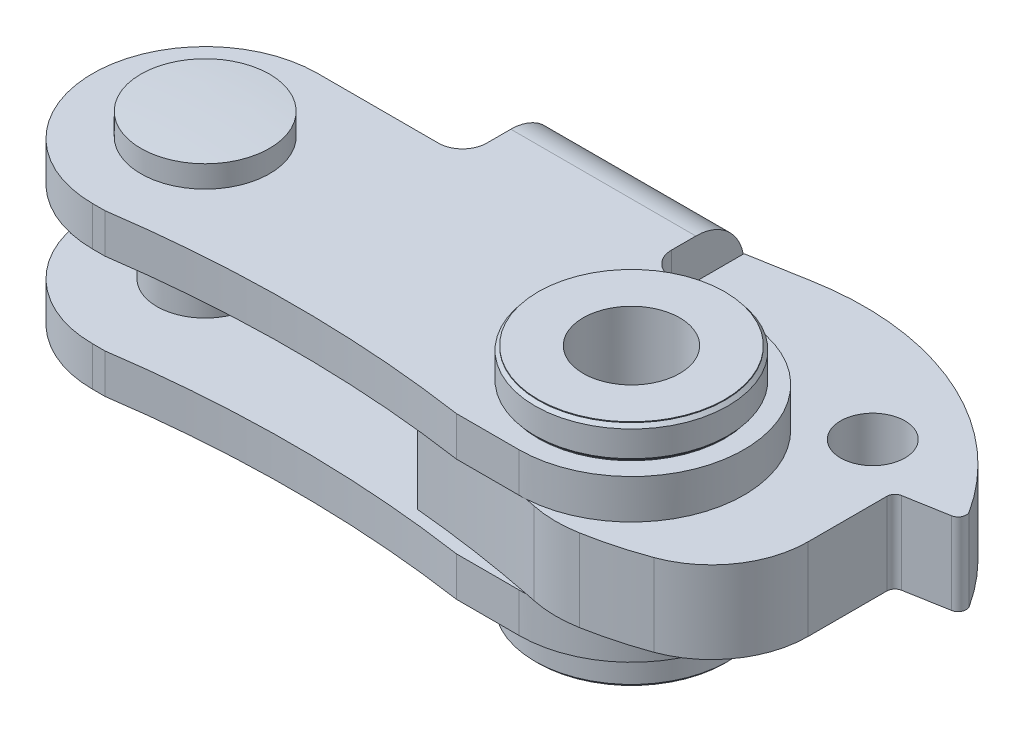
ISO-10303-21;
HEADER;
FILE_DESCRIPTION(('STEP AP214'),'2;1');
FILE_NAME('part.step','',(''),(''),'','','');
FILE_SCHEMA(('AUTOMOTIVE_DESIGN { 1 0 10303 214 1 1 1 1 }'));
ENDSEC;
DATA;
#1=APPLICATION_CONTEXT('core data for automotive mechanical design processes');
#2=APPLICATION_PROTOCOL_DEFINITION('international standard','automotive_design',2000,#1);
#3=PRODUCT_CONTEXT('',#1,'mechanical');
#4=PRODUCT('Part','Part','',(#3));
#5=PRODUCT_RELATED_PRODUCT_CATEGORY('part','',(#4));
#6=PRODUCT_DEFINITION_FORMATION('','',#4);
#7=PRODUCT_DEFINITION_CONTEXT('part definition',#1,'design');
#8=PRODUCT_DEFINITION('design','',#6,#7);
#9=PRODUCT_DEFINITION_SHAPE('','',#8);
#10=(LENGTH_UNIT() NAMED_UNIT(*) SI_UNIT(.MILLI.,.METRE.));
#11=(NAMED_UNIT(*) PLANE_ANGLE_UNIT() SI_UNIT($,.RADIAN.));
#12=(NAMED_UNIT(*) SI_UNIT($,.STERADIAN.) SOLID_ANGLE_UNIT());
#13=UNCERTAINTY_MEASURE_WITH_UNIT(LENGTH_MEASURE(1.E-05),#10,'distance_accuracy_value','');
#14=(GEOMETRIC_REPRESENTATION_CONTEXT(3) GLOBAL_UNCERTAINTY_ASSIGNED_CONTEXT((#13)) GLOBAL_UNIT_ASSIGNED_CONTEXT((#10,
#11,#12)) REPRESENTATION_CONTEXT('',''));
#15=CARTESIAN_POINT('',(0.,0.,0.));
#16=DIRECTION('',(0.,0.,1.));
#17=DIRECTION('',(1.,0.,0.));
#18=AXIS2_PLACEMENT_3D('',#15,#16,#17);
#19=CARTESIAN_POINT('',(7.4999999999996,-5.,-8.50000000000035));
#20=DIRECTION('',(0.,1.,0.));
#21=DIRECTION('',(0.,0.,1.));
#22=AXIS2_PLACEMENT_3D('',#19,#20,#21);
#23=CYLINDRICAL_SURFACE('',#22,1.50000000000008);
#24=DIRECTION('',(0.,1.,0.));
#25=VECTOR('',#24,1.);
#26=CARTESIAN_POINT('',(8.9999999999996,-5.,-8.50000000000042));
#27=LINE('',#26,#25);
#28=CARTESIAN_POINT('',(8.9999999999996,2.55,-8.50000000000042));
#29=VERTEX_POINT('',#28);
#30=CARTESIAN_POINT('',(8.9999999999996,5.,-8.50000000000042));
#31=VERTEX_POINT('',#30);
#32=EDGE_CURVE('E713',#29,#31,#27,.T.);
#33=ORIENTED_EDGE('',*,*,#32,.F.);
#34=CARTESIAN_POINT('',(7.4999999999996,2.55,-8.50000000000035));
#35=DIRECTION('',(0.,1.,0.));
#36=DIRECTION('',(1.,0.,0.));
#37=AXIS2_PLACEMENT_3D('',#34,#35,#36);
#38=CIRCLE('',#37,1.5);
#39=CARTESIAN_POINT('',(7.49999999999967,2.55,-7.00000000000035));
#40=VERTEX_POINT('',#39);
#41=EDGE_CURVE('E453',#40,#29,#38,.T.);
#42=ORIENTED_EDGE('',*,*,#41,.F.);
#43=DIRECTION('',(0.,1.,0.));
#44=VECTOR('',#43,1.);
#45=CARTESIAN_POINT('',(7.49999999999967,-5.,-7.00000000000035));
#46=LINE('',#45,#44);
#47=CARTESIAN_POINT('',(7.49999999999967,5.,-7.00000000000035));
#48=VERTEX_POINT('',#47);
#49=EDGE_CURVE('E709',#40,#48,#46,.T.);
#50=ORIENTED_EDGE('',*,*,#49,.T.);
#51=CARTESIAN_POINT('',(7.4999999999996,5.,-8.50000000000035));
#52=DIRECTION('',(0.,-1.,0.));
#53=DIRECTION('',(0.,0.,-1.));
#54=AXIS2_PLACEMENT_3D('',#51,#52,#53);
#55=CIRCLE('',#54,1.50000000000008);
#56=EDGE_CURVE('E634',#31,#48,#55,.T.);
#57=ORIENTED_EDGE('',*,*,#56,.F.);
#58=EDGE_LOOP('',(#33,#42,#50,#57));
#59=FACE_BOUND('',#58,.T.);
#60=ADVANCED_FACE('F14',(#59),#23,.F.);
#61=CARTESIAN_POINT('',(7.49999999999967,-5.,-7.00000000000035));
#62=DIRECTION('',(0.,0.,-1.));
#63=DIRECTION('',(0.,1.,0.));
#64=AXIS2_PLACEMENT_3D('',#61,#62,#63);
#65=PLANE('',#64);
#66=ORIENTED_EDGE('',*,*,#49,.F.);
#67=DIRECTION('',(1.,0.,0.));
#68=VECTOR('',#67,1.);
#69=CARTESIAN_POINT('',(-3.28706032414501E-13,2.55,-7.));
#70=LINE('',#69,#68);
#71=CARTESIAN_POINT('',(-3.29991869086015E-13,2.55,-7.));
#72=VERTEX_POINT('',#71);
#73=EDGE_CURVE('E451',#72,#40,#70,.T.);
#74=ORIENTED_EDGE('',*,*,#73,.F.);
#75=DIRECTION('',(0.,1.,0.));
#76=VECTOR('',#75,1.);
#77=CARTESIAN_POINT('',(-3.28702970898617E-13,-5.,-7.));
#78=LINE('',#77,#76);
#79=CARTESIAN_POINT('',(-3.28702970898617E-13,5.,-7.));
#80=VERTEX_POINT('',#79);
#81=EDGE_CURVE('E705',#72,#80,#78,.T.);
#82=ORIENTED_EDGE('',*,*,#81,.T.);
#83=DIRECTION('',(-1.,0.,0.));
#84=VECTOR('',#83,1.);
#85=CARTESIAN_POINT('',(7.49999999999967,5.,-7.00000000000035));
#86=LINE('',#85,#84);
#87=EDGE_CURVE('E637',#48,#80,#86,.T.);
#88=ORIENTED_EDGE('',*,*,#87,.F.);
#89=EDGE_LOOP('',(#66,#74,#82,#88));
#90=FACE_BOUND('',#89,.T.);
#91=ADVANCED_FACE('F756',(#90),#65,.T.);
#92=CARTESIAN_POINT('',(0.,-5.,0.));
#93=DIRECTION('',(0.,1.,0.));
#94=DIRECTION('',(0.,0.,1.));
#95=AXIS2_PLACEMENT_3D('',#92,#93,#94);
#96=CYLINDRICAL_SURFACE('',#95,7.);
#97=ORIENTED_EDGE('',*,*,#81,.F.);
#98=CARTESIAN_POINT('',(0.,2.55,0.));
#99=DIRECTION('',(0.,-1.,0.));
#100=DIRECTION('',(1.,0.,0.));
#101=AXIS2_PLACEMENT_3D('',#98,#99,#100);
#102=CIRCLE('',#101,7.);
#103=CARTESIAN_POINT('',(3.27218133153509E-13,2.55,7.));
#104=VERTEX_POINT('',#103);
#105=EDGE_CURVE('E449',#104,#72,#102,.T.);
#106=ORIENTED_EDGE('',*,*,#105,.F.);
#107=DIRECTION('',(0.,1.,0.));
#108=VECTOR('',#107,1.);
#109=CARTESIAN_POINT('',(3.27221197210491E-13,-5.,7.));
#110=LINE('',#109,#108);
#111=CARTESIAN_POINT('',(3.27221197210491E-13,5.,7.));
#112=VERTEX_POINT('',#111);
#113=EDGE_CURVE('E701',#104,#112,#110,.T.);
#114=ORIENTED_EDGE('',*,*,#113,.T.);
#115=CARTESIAN_POINT('',(0.,5.,0.));
#116=DIRECTION('',(0.,1.,0.));
#117=DIRECTION('',(0.,0.,-1.));
#118=AXIS2_PLACEMENT_3D('',#115,#116,#117);
#119=CIRCLE('',#118,7.);
#120=EDGE_CURVE('E640',#80,#112,#119,.T.);
#121=ORIENTED_EDGE('',*,*,#120,.F.);
#122=EDGE_LOOP('',(#97,#106,#114,#121));
#123=FACE_BOUND('',#122,.T.);
#124=ADVANCED_FACE('F764',(#123),#96,.T.);
#125=CARTESIAN_POINT('',(3.28078421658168E-13,-5.,7.));
#126=DIRECTION('',(0.,0.,1.));
#127=DIRECTION('',(0.,-1.,0.));
#128=AXIS2_PLACEMENT_3D('',#125,#126,#127);
#129=PLANE('',#128);
#130=ORIENTED_EDGE('',*,*,#113,.F.);
#131=DIRECTION('',(-1.,0.,0.));
#132=VECTOR('',#131,1.);
#133=CARTESIAN_POINT('',(0.774799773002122,2.55,7.));
#134=LINE('',#133,#132);
#135=CARTESIAN_POINT('',(0.774799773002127,2.55,7.));
#136=VERTEX_POINT('',#135);
#137=EDGE_CURVE('E447',#136,#104,#134,.T.);
#138=ORIENTED_EDGE('',*,*,#137,.F.);
#139=DIRECTION('',(0.,-1.,0.));
#140=VECTOR('',#139,1.);
#141=CARTESIAN_POINT('',(0.774799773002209,10.,7.));
#142=LINE('',#141,#140);
#143=CARTESIAN_POINT('',(0.774799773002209,5.,7.));
#144=VERTEX_POINT('',#143);
#145=EDGE_CURVE('E723',#136,#144,#142,.F.);
#146=ORIENTED_EDGE('',*,*,#145,.T.);
#147=DIRECTION('',(1.,0.,0.));
#148=VECTOR('',#147,1.);
#149=CARTESIAN_POINT('',(3.28078421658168E-13,5.,7.));
#150=LINE('',#149,#148);
#151=EDGE_CURVE('E644',#112,#144,#150,.T.);
#152=ORIENTED_EDGE('',*,*,#151,.F.);
#153=EDGE_LOOP('',(#130,#138,#146,#152));
#154=FACE_BOUND('',#153,.T.);
#155=ADVANCED_FACE('F781',(#154),#129,.T.);
#156=CARTESIAN_POINT('',(11.7000000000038,10.,81.2));
#157=DIRECTION('',(0.,-1.,0.));
#158=DIRECTION('',(0.,0.,-1.));
#159=AXIS2_PLACEMENT_3D('',#156,#157,#158);
#160=CYLINDRICAL_SURFACE('',#159,75.);
#161=ORIENTED_EDGE('',*,*,#145,.F.);
#162=CARTESIAN_POINT('',(11.7000000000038,2.55,81.2));
#163=DIRECTION('',(0.,1.,0.));
#164=DIRECTION('',(1.,0.,0.));
#165=AXIS2_PLACEMENT_3D('',#162,#163,#164);
#166=CIRCLE('',#165,75.);
#167=CARTESIAN_POINT('',(22.6252002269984,2.55,6.99999999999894));
#168=VERTEX_POINT('',#167);
#169=EDGE_CURVE('E445',#168,#136,#166,.T.);
#170=ORIENTED_EDGE('',*,*,#169,.F.);
#171=DIRECTION('',(0.,-1.,0.));
#172=VECTOR('',#171,1.);
#173=CARTESIAN_POINT('',(22.6252002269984,10.,6.99999999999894));
#174=LINE('',#173,#172);
#175=CARTESIAN_POINT('',(22.6252002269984,5.,6.99999999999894));
#176=VERTEX_POINT('',#175);
#177=EDGE_CURVE('E720',#176,#168,#174,.T.);
#178=ORIENTED_EDGE('',*,*,#177,.F.);
#179=CARTESIAN_POINT('',(11.7000000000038,5.,81.2));
#180=DIRECTION('',(0.,-1.,0.));
#181=DIRECTION('',(0.,0.,-1.));
#182=AXIS2_PLACEMENT_3D('',#179,#180,#181);
#183=CIRCLE('',#182,75.);
#184=EDGE_CURVE('E576',#176,#144,#183,.F.);
#185=ORIENTED_EDGE('',*,*,#184,.T.);
#186=EDGE_LOOP('',(#161,#170,#178,#185));
#187=FACE_BOUND('',#186,.T.);
#188=ADVANCED_FACE('F967',(#187),#160,.F.);
#189=ORIENTED_EDGE('',*,*,#177,.T.);
#190=DIRECTION('',(-1.,0.,0.));
#191=VECTOR('',#190,1.);
#192=CARTESIAN_POINT('',(26.5000000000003,2.55,6.99999999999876));
#193=LINE('',#192,#191);
#194=CARTESIAN_POINT('',(26.5000000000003,2.55,6.99999999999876));
#195=VERTEX_POINT('',#194);
#196=EDGE_CURVE('E443',#195,#168,#193,.T.);
#197=ORIENTED_EDGE('',*,*,#196,.F.);
#198=DIRECTION('',(0.,1.,0.));
#199=VECTOR('',#198,1.);
#200=CARTESIAN_POINT('',(26.5000000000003,-5.,6.99999999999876));
#201=LINE('',#200,#199);
#202=CARTESIAN_POINT('',(26.5000000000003,5.,6.99999999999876));
#203=VERTEX_POINT('',#202);
#204=EDGE_CURVE('E697',#195,#203,#201,.T.);
#205=ORIENTED_EDGE('',*,*,#204,.T.);
#206=EDGE_CURVE('E643',#176,#203,#150,.T.);
#207=ORIENTED_EDGE('',*,*,#206,.F.);
#208=EDGE_LOOP('',(#189,#197,#205,#207));
#209=FACE_BOUND('',#208,.T.);
#210=ADVANCED_FACE('F970',(#209),#129,.T.);
#211=CARTESIAN_POINT('',(11.7000000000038,-10.,81.2));
#212=DIRECTION('',(0.,1.,0.));
#213=DIRECTION('',(0.,0.,1.));
#214=AXIS2_PLACEMENT_3D('',#211,#212,#213);
#215=CYLINDRICAL_SURFACE('',#214,75.);
#216=CARTESIAN_POINT('',(11.7000000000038,-2.55,81.2));
#217=DIRECTION('',(0.,-1.,0.));
#218=DIRECTION('',(0.,0.,1.));
#219=AXIS2_PLACEMENT_3D('',#216,#217,#218);
#220=CIRCLE('',#219,75.);
#221=CARTESIAN_POINT('',(0.774799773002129,-2.55,7.));
#222=VERTEX_POINT('',#221);
#223=CARTESIAN_POINT('',(22.6252002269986,-2.55,6.99999999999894));
#224=VERTEX_POINT('',#223);
#225=EDGE_CURVE('E490',#222,#224,#220,.T.);
#226=ORIENTED_EDGE('',*,*,#225,.F.);
#227=DIRECTION('',(0.,1.,0.));
#228=VECTOR('',#227,1.);
#229=CARTESIAN_POINT('',(0.774799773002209,-10.,7.));
#230=LINE('',#229,#228);
#231=CARTESIAN_POINT('',(0.774799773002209,-5.,7.));
#232=VERTEX_POINT('',#231);
#233=EDGE_CURVE('E579',#222,#232,#230,.F.);
#234=ORIENTED_EDGE('',*,*,#233,.T.);
#235=CARTESIAN_POINT('',(11.7000000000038,-5.,81.2));
#236=DIRECTION('',(0.,-1.,0.));
#237=DIRECTION('',(0.,0.,-1.));
#238=AXIS2_PLACEMENT_3D('',#235,#236,#237);
#239=CIRCLE('',#238,75.);
#240=CARTESIAN_POINT('',(22.6252002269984,-5.,6.99999999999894));
#241=VERTEX_POINT('',#240);
#242=EDGE_CURVE('E585',#232,#241,#239,.T.);
#243=ORIENTED_EDGE('',*,*,#242,.T.);
#244=DIRECTION('',(0.,1.,0.));
#245=VECTOR('',#244,1.);
#246=CARTESIAN_POINT('',(22.6252002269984,-10.,6.99999999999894));
#247=LINE('',#246,#245);
#248=EDGE_CURVE('E582',#241,#224,#247,.T.);
#249=ORIENTED_EDGE('',*,*,#248,.T.);
#250=EDGE_LOOP('',(#226,#234,#243,#249));
#251=FACE_BOUND('',#250,.T.);
#252=ADVANCED_FACE('F803',(#251),#215,.F.);
#253=ORIENTED_EDGE('',*,*,#233,.F.);
#254=DIRECTION('',(1.,0.,0.));
#255=VECTOR('',#254,1.);
#256=CARTESIAN_POINT('',(3.28078421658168E-13,-2.55,7.));
#257=LINE('',#256,#255);
#258=CARTESIAN_POINT('',(3.28078421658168E-13,-2.55,7.));
#259=VERTEX_POINT('',#258);
#260=EDGE_CURVE('E488',#259,#222,#257,.T.);
#261=ORIENTED_EDGE('',*,*,#260,.F.);
#262=CARTESIAN_POINT('',(3.27221197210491E-13,-5.,7.));
#263=VERTEX_POINT('',#262);
#264=EDGE_CURVE('E702',#263,#259,#110,.T.);
#265=ORIENTED_EDGE('',*,*,#264,.F.);
#266=DIRECTION('',(1.,0.,0.));
#267=VECTOR('',#266,1.);
#268=CARTESIAN_POINT('',(3.28078421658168E-13,-5.,7.));
#269=LINE('',#268,#267);
#270=EDGE_CURVE('E670',#263,#232,#269,.T.);
#271=ORIENTED_EDGE('',*,*,#270,.T.);
#272=EDGE_LOOP('',(#253,#261,#265,#271));
#273=FACE_BOUND('',#272,.T.);
#274=ADVANCED_FACE('F782',(#273),#129,.T.);
#275=ORIENTED_EDGE('',*,*,#264,.T.);
#276=CARTESIAN_POINT('',(0.,-2.55,0.));
#277=DIRECTION('',(0.,1.,0.));
#278=DIRECTION('',(0.,0.,1.));
#279=AXIS2_PLACEMENT_3D('',#276,#277,#278);
#280=CIRCLE('',#279,7.);
#281=CARTESIAN_POINT('',(-3.28702970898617E-13,-2.55,-7.));
#282=VERTEX_POINT('',#281);
#283=EDGE_CURVE('E486',#282,#259,#280,.T.);
#284=ORIENTED_EDGE('',*,*,#283,.F.);
#285=CARTESIAN_POINT('',(-3.28702970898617E-13,-5.,-7.));
#286=VERTEX_POINT('',#285);
#287=EDGE_CURVE('E706',#286,#282,#78,.T.);
#288=ORIENTED_EDGE('',*,*,#287,.F.);
#289=CARTESIAN_POINT('',(0.,-5.,0.));
#290=DIRECTION('',(0.,1.,0.));
#291=DIRECTION('',(0.,0.,-1.));
#292=AXIS2_PLACEMENT_3D('',#289,#290,#291);
#293=CIRCLE('',#292,7.);
#294=EDGE_CURVE('E666',#286,#263,#293,.T.);
#295=ORIENTED_EDGE('',*,*,#294,.T.);
#296=EDGE_LOOP('',(#275,#284,#288,#295));
#297=FACE_BOUND('',#296,.T.);
#298=ADVANCED_FACE('F784',(#297),#96,.T.);
#299=ORIENTED_EDGE('',*,*,#287,.T.);
#300=DIRECTION('',(-1.,0.,0.));
#301=VECTOR('',#300,1.);
#302=CARTESIAN_POINT('',(7.49999999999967,-2.55,-7.00000000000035));
#303=LINE('',#302,#301);
#304=CARTESIAN_POINT('',(7.49999999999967,-2.55,-7.00000000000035));
#305=VERTEX_POINT('',#304);
#306=EDGE_CURVE('E484',#305,#282,#303,.T.);
#307=ORIENTED_EDGE('',*,*,#306,.F.);
#308=CARTESIAN_POINT('',(7.49999999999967,-5.,-7.00000000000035));
#309=VERTEX_POINT('',#308);
#310=EDGE_CURVE('E710',#309,#305,#46,.T.);
#311=ORIENTED_EDGE('',*,*,#310,.F.);
#312=DIRECTION('',(-1.,0.,0.));
#313=VECTOR('',#312,1.);
#314=CARTESIAN_POINT('',(7.49999999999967,-5.,-7.00000000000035));
#315=LINE('',#314,#313);
#316=EDGE_CURVE('E663',#309,#286,#315,.T.);
#317=ORIENTED_EDGE('',*,*,#316,.T.);
#318=EDGE_LOOP('',(#299,#307,#311,#317));
#319=FACE_BOUND('',#318,.T.);
#320=ADVANCED_FACE('F767',(#319),#65,.T.);
#321=ORIENTED_EDGE('',*,*,#310,.T.);
#322=CARTESIAN_POINT('',(7.4999999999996,-2.55,-8.50000000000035));
#323=DIRECTION('',(0.,-1.,0.));
#324=DIRECTION('',(0.,0.,1.));
#325=AXIS2_PLACEMENT_3D('',#322,#323,#324);
#326=CIRCLE('',#325,1.5);
#327=CARTESIAN_POINT('',(8.9999999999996,-2.55,-8.50000000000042));
#328=VERTEX_POINT('',#327);
#329=EDGE_CURVE('E482',#328,#305,#326,.T.);
#330=ORIENTED_EDGE('',*,*,#329,.F.);
#331=CARTESIAN_POINT('',(8.9999999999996,-5.,-8.50000000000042));
#332=VERTEX_POINT('',#331);
#333=EDGE_CURVE('E714',#332,#328,#27,.T.);
#334=ORIENTED_EDGE('',*,*,#333,.F.);
#335=CARTESIAN_POINT('',(7.4999999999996,-5.,-8.50000000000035));
#336=DIRECTION('',(0.,-1.,0.));
#337=DIRECTION('',(0.,0.,-1.));
#338=AXIS2_PLACEMENT_3D('',#335,#336,#337);
#339=CIRCLE('',#338,1.50000000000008);
#340=EDGE_CURVE('E660',#332,#309,#339,.T.);
#341=ORIENTED_EDGE('',*,*,#340,.T.);
#342=EDGE_LOOP('',(#321,#330,#334,#341));
#343=FACE_BOUND('',#342,.T.);
#344=ADVANCED_FACE('F759',(#343),#23,.F.);
#345=CARTESIAN_POINT('',(26.5000000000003,-5.,6.99999999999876));
#346=VERTEX_POINT('',#345);
#347=CARTESIAN_POINT('',(26.5000000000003,-2.55,6.99999999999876));
#348=VERTEX_POINT('',#347);
#349=EDGE_CURVE('E698',#346,#348,#201,.T.);
#350=ORIENTED_EDGE('',*,*,#349,.T.);
#351=DIRECTION('',(1.,0.,0.));
#352=VECTOR('',#351,1.);
#353=CARTESIAN_POINT('',(22.6252002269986,-2.55,6.99999999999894));
#354=LINE('',#353,#352);
#355=EDGE_CURVE('E492',#224,#348,#354,.T.);
#356=ORIENTED_EDGE('',*,*,#355,.F.);
#357=ORIENTED_EDGE('',*,*,#248,.F.);
#358=EDGE_CURVE('E669',#241,#346,#269,.T.);
#359=ORIENTED_EDGE('',*,*,#358,.T.);
#360=EDGE_LOOP('',(#350,#356,#357,#359));
#361=FACE_BOUND('',#360,.T.);
#362=ADVANCED_FACE('F771',(#361),#129,.T.);
#363=CARTESIAN_POINT('',(11.1999999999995,0.,-10.0000000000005));
#364=DIRECTION('',(0.707106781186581,0.,0.707106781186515));
#365=DIRECTION('',(0.707106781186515,0.,-0.707106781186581));
#366=AXIS2_PLACEMENT_3D('',#363,#364,#365);
#367=PLANE('',#366);
#368=DIRECTION('',(0.,-1.,0.));
#369=VECTOR('',#368,1.);
#370=CARTESIAN_POINT('',(11.1999999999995,0.,-10.0000000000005));
#371=LINE('',#370,#369);
#372=CARTESIAN_POINT('',(11.1999999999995,2.5,-10.0000000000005));
#373=VERTEX_POINT('',#372);
#374=CARTESIAN_POINT('',(11.1999999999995,-2.5,-10.0000000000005));
#375=VERTEX_POINT('',#374);
#376=EDGE_CURVE('E329',#373,#375,#371,.T.);
#377=ORIENTED_EDGE('',*,*,#376,.T.);
#378=DIRECTION('',(0.,1.,0.));
#379=VECTOR('',#378,1.);
#380=CARTESIAN_POINT('',(11.1999999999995,-2.55,-10.0000000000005));
#381=LINE('',#380,#379);
#382=CARTESIAN_POINT('',(11.1999999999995,-2.55,-10.0000000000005));
#383=VERTEX_POINT('',#382);
#384=EDGE_CURVE('E494',#383,#375,#381,.T.);
#385=ORIENTED_EDGE('',*,*,#384,.F.);
#386=DIRECTION('',(0.707106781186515,0.,-0.707106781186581));
#387=VECTOR('',#386,1.);
#388=CARTESIAN_POINT('',(8.49999999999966,-2.55,-7.3000000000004));
#389=LINE('',#388,#387);
#390=CARTESIAN_POINT('',(8.49999999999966,-2.55,-7.3000000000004));
#391=VERTEX_POINT('',#390);
#392=EDGE_CURVE('E474',#391,#383,#389,.T.);
#393=ORIENTED_EDGE('',*,*,#392,.F.);
#394=DIRECTION('',(0.,-1.,0.));
#395=VECTOR('',#394,1.);
#396=CARTESIAN_POINT('',(8.49999999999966,0.,-7.3000000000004));
#397=LINE('',#396,#395);
#398=CARTESIAN_POINT('',(8.49999999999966,2.55,-7.3000000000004));
#399=VERTEX_POINT('',#398);
#400=EDGE_CURVE('E529',#399,#391,#397,.T.);
#401=ORIENTED_EDGE('',*,*,#400,.F.);
#402=DIRECTION('',(-0.707106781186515,0.,0.707106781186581));
#403=VECTOR('',#402,1.);
#404=CARTESIAN_POINT('',(11.1999999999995,2.55,-10.0000000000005));
#405=LINE('',#404,#403);
#406=CARTESIAN_POINT('',(11.1999999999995,2.55,-10.0000000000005));
#407=VERTEX_POINT('',#406);
#408=EDGE_CURVE('E429',#407,#399,#405,.T.);
#409=ORIENTED_EDGE('',*,*,#408,.F.);
#410=DIRECTION('',(0.,-1.,0.));
#411=VECTOR('',#410,1.);
#412=CARTESIAN_POINT('',(11.1999999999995,2.55,-10.0000000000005));
#413=LINE('',#412,#411);
#414=EDGE_CURVE('E456',#407,#373,#413,.T.);
#415=ORIENTED_EDGE('',*,*,#414,.T.);
#416=EDGE_LOOP('',(#377,#385,#393,#401,#409,#415));
#417=FACE_BOUND('',#416,.T.);
#418=ADVANCED_FACE('F778',(#417),#367,.F.);
#419=CARTESIAN_POINT('',(20.4999999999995,0.,-10.000000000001));
#420=DIRECTION('',(0.,0.,1.));
#421=DIRECTION('',(0.,-1.,0.));
#422=AXIS2_PLACEMENT_3D('',#419,#420,#421);
#423=PLANE('',#422);
#424=DIRECTION('',(-1.,0.,0.));
#425=VECTOR('',#424,1.);
#426=CARTESIAN_POINT('',(20.4999999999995,2.5,-10.000000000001));
#427=LINE('',#426,#425);
#428=CARTESIAN_POINT('',(20.4499999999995,2.5,-10.000000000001));
#429=VERTEX_POINT('',#428);
#430=EDGE_CURVE('E505',#429,#373,#427,.T.);
#431=ORIENTED_EDGE('',*,*,#430,.F.);
#432=DIRECTION('',(0.,1.,0.));
#433=VECTOR('',#432,1.);
#434=CARTESIAN_POINT('',(20.4499999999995,-2.5,-10.000000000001));
#435=LINE('',#434,#433);
#436=CARTESIAN_POINT('',(20.4499999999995,-2.5,-10.000000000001));
#437=VERTEX_POINT('',#436);
#438=EDGE_CURVE('E502',#437,#429,#435,.T.);
#439=ORIENTED_EDGE('',*,*,#438,.F.);
#440=DIRECTION('',(-1.,0.,0.));
#441=VECTOR('',#440,1.);
#442=CARTESIAN_POINT('',(20.4999999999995,-2.5,-10.000000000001));
#443=LINE('',#442,#441);
#444=EDGE_CURVE('E507',#437,#375,#443,.T.);
#445=ORIENTED_EDGE('',*,*,#444,.T.);
#446=ORIENTED_EDGE('',*,*,#376,.F.);
#447=EDGE_LOOP('',(#431,#439,#445,#446));
#448=FACE_BOUND('',#447,.T.);
#449=ADVANCED_FACE('F916',(#448),#423,.F.);
#450=CARTESIAN_POINT('',(20.4499999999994,-2.5,-12.997818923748));
#451=DIRECTION('',(-1.,0.,0.));
#452=DIRECTION('',(0.,1.,0.));
#453=AXIS2_PLACEMENT_3D('',#450,#451,#452);
#454=PLANE('',#453);
#455=CARTESIAN_POINT('',(20.4499999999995,1.99999999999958,-10.0000000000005));
#456=DIRECTION('',(-1.,0.,0.));
#457=DIRECTION('',(0.,-1.,0.));
#458=AXIS2_PLACEMENT_3D('',#455,#456,#457);
#459=CIRCLE('',#458,0.500000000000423);
#460=CARTESIAN_POINT('',(20.4499999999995,2.,-10.500000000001));
#461=VERTEX_POINT('',#460);
#462=EDGE_CURVE('E543',#461,#429,#459,.F.);
#463=ORIENTED_EDGE('',*,*,#462,.F.);
#464=DIRECTION('',(0.,1.,0.));
#465=VECTOR('',#464,1.);
#466=CARTESIAN_POINT('',(20.4499999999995,-2.5,-10.500000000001));
#467=LINE('',#466,#465);
#468=CARTESIAN_POINT('',(20.4499999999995,-2.,-10.500000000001));
#469=VERTEX_POINT('',#468);
#470=EDGE_CURVE('E540',#469,#461,#467,.T.);
#471=ORIENTED_EDGE('',*,*,#470,.F.);
#472=CARTESIAN_POINT('',(20.4499999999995,-1.99999999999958,-10.0000000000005));
#473=DIRECTION('',(-1.,0.,0.));
#474=DIRECTION('',(0.,-1.,0.));
#475=AXIS2_PLACEMENT_3D('',#472,#473,#474);
#476=CIRCLE('',#475,0.500000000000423);
#477=EDGE_CURVE('E536',#437,#469,#476,.F.);
#478=ORIENTED_EDGE('',*,*,#477,.F.);
#479=ORIENTED_EDGE('',*,*,#438,.T.);
#480=EDGE_LOOP('',(#463,#471,#478,#479));
#481=FACE_BOUND('',#480,.T.);
#482=ADVANCED_FACE('F913',(#481),#454,.T.);
#483=CARTESIAN_POINT('',(8.49999999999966,0.,-7.3000000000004));
#484=DIRECTION('',(1.,0.,0.));
#485=DIRECTION('',(0.,1.,0.));
#486=AXIS2_PLACEMENT_3D('',#483,#484,#485);
#487=PLANE('',#486);
#488=ORIENTED_EDGE('',*,*,#400,.T.);
#489=DIRECTION('',(0.,0.,-1.));
#490=VECTOR('',#489,1.);
#491=CARTESIAN_POINT('',(8.49999999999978,-2.55,-4.7000000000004));
#492=LINE('',#491,#490);
#493=CARTESIAN_POINT('',(8.49999999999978,-2.55,-4.7000000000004));
#494=VERTEX_POINT('',#493);
#495=EDGE_CURVE('E471',#494,#391,#492,.T.);
#496=ORIENTED_EDGE('',*,*,#495,.F.);
#497=DIRECTION('',(0.,-1.,0.));
#498=VECTOR('',#497,1.);
#499=CARTESIAN_POINT('',(8.49999999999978,0.,-4.7000000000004));
#500=LINE('',#499,#498);
#501=CARTESIAN_POINT('',(8.49999999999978,2.55,-4.7000000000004));
#502=VERTEX_POINT('',#501);
#503=EDGE_CURVE('E527',#502,#494,#500,.T.);
#504=ORIENTED_EDGE('',*,*,#503,.F.);
#505=DIRECTION('',(0.,0.,1.));
#506=VECTOR('',#505,1.);
#507=CARTESIAN_POINT('',(8.49999999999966,2.55,-7.3000000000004));
#508=LINE('',#507,#506);
#509=EDGE_CURVE('E432',#399,#502,#508,.T.);
#510=ORIENTED_EDGE('',*,*,#509,.F.);
#511=EDGE_LOOP('',(#488,#496,#504,#510));
#512=FACE_BOUND('',#511,.T.);
#513=ADVANCED_FACE('F831',(#512),#487,.F.);
#514=CARTESIAN_POINT('',(8.49999999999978,0.,-4.7000000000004));
#515=DIRECTION('',(0.707106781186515,0.,-0.707106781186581));
#516=DIRECTION('',(-0.707106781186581,0.,-0.707106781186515));
#517=AXIS2_PLACEMENT_3D('',#514,#515,#516);
#518=PLANE('',#517);
#519=ORIENTED_EDGE('',*,*,#503,.T.);
#520=DIRECTION('',(-0.707106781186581,0.,-0.707106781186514));
#521=VECTOR('',#520,1.);
#522=CARTESIAN_POINT('',(19.0199173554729,-2.55,5.81991735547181));
#523=LINE('',#522,#521);
#524=CARTESIAN_POINT('',(19.0199173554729,-2.55,5.81991735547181));
#525=VERTEX_POINT('',#524);
#526=EDGE_CURVE('E468',#525,#494,#523,.T.);
#527=ORIENTED_EDGE('',*,*,#526,.F.);
#528=DIRECTION('',(0.,-1.,0.));
#529=VECTOR('',#528,1.);
#530=CARTESIAN_POINT('',(19.0199173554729,0.,5.81991735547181));
#531=LINE('',#530,#529);
#532=CARTESIAN_POINT('',(19.0199173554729,2.55,5.81991735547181));
#533=VERTEX_POINT('',#532);
#534=EDGE_CURVE('E525',#533,#525,#531,.T.);
#535=ORIENTED_EDGE('',*,*,#534,.F.);
#536=DIRECTION('',(0.707106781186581,0.,0.707106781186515));
#537=VECTOR('',#536,1.);
#538=CARTESIAN_POINT('',(8.49999999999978,2.55,-4.7000000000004));
#539=LINE('',#538,#537);
#540=EDGE_CURVE('E435',#502,#533,#539,.T.);
#541=ORIENTED_EDGE('',*,*,#540,.F.);
#542=EDGE_LOOP('',(#519,#527,#535,#541));
#543=FACE_BOUND('',#542,.T.);
#544=ADVANCED_FACE('F827',(#543),#518,.F.);
#545=CARTESIAN_POINT('',(34.5,0.,-7.00000000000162));
#546=DIRECTION('',(0.,-1.,0.));
#547=DIRECTION('',(0.,0.,-1.));
#548=AXIS2_PLACEMENT_3D('',#545,#546,#547);
#549=CYLINDRICAL_SURFACE('',#548,2.);
#550=CARTESIAN_POINT('',(34.5,2.55,-7.00000000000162));
#551=DIRECTION('',(0.,1.,0.));
#552=DIRECTION('',(0.,0.,1.));
#553=AXIS2_PLACEMENT_3D('',#550,#551,#552);
#554=CIRCLE('',#553,2.);
#555=CARTESIAN_POINT('',(34.5000000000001,2.55,-5.00000000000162));
#556=VERTEX_POINT('',#555);
#557=EDGE_CURVE('E377',#556,#556,#554,.T.);
#558=ORIENTED_EDGE('',*,*,#557,.T.);
#559=EDGE_LOOP('',(#558));
#560=FACE_BOUND('',#559,.T.);
#561=CARTESIAN_POINT('',(34.5,-2.55,-7.00000000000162));
#562=DIRECTION('',(0.,-1.,0.));
#563=DIRECTION('',(0.,0.,-1.));
#564=AXIS2_PLACEMENT_3D('',#561,#562,#563);
#565=CIRCLE('',#564,2.);
#566=CARTESIAN_POINT('',(34.4999999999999,-2.55,-9.00000000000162));
#567=VERTEX_POINT('',#566);
#568=EDGE_CURVE('E2083',#567,#567,#565,.T.);
#569=ORIENTED_EDGE('',*,*,#568,.T.);
#570=EDGE_LOOP('',(#569));
#571=FACE_BOUND('',#570,.T.);
#572=ADVANCED_FACE('F910',(#560,#571),#549,.F.);
#573=CARTESIAN_POINT('',(40.9733377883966,0.,-5.8319929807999));
#574=DIRECTION('',(0.,-1.,0.));
#575=DIRECTION('',(0.,0.,-1.));
#576=AXIS2_PLACEMENT_3D('',#573,#574,#575);
#577=CYLINDRICAL_SURFACE('',#576,0.500000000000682);
#578=DIRECTION('',(0.,-1.,0.));
#579=VECTOR('',#578,1.);
#580=CARTESIAN_POINT('',(41.0601618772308,0.,-5.33958910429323));
#581=LINE('',#580,#579);
#582=CARTESIAN_POINT('',(41.0601618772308,2.55,-5.33958910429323));
#583=VERTEX_POINT('',#582);
#584=CARTESIAN_POINT('',(41.0601618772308,-2.55,-5.33958910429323));
#585=VERTEX_POINT('',#584);
#586=EDGE_CURVE('E511',#583,#585,#581,.T.);
#587=ORIENTED_EDGE('',*,*,#586,.T.);
#588=CARTESIAN_POINT('',(40.9733377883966,-2.55,-5.8319929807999));
#589=DIRECTION('',(0.,-1.,0.));
#590=DIRECTION('',(0.,0.,-1.));
#591=AXIS2_PLACEMENT_3D('',#588,#589,#590);
#592=CIRCLE('',#591,0.500000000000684);
#593=CARTESIAN_POINT('',(41.3937419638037,-2.55,-6.10265943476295));
#594=VERTEX_POINT('',#593);
#595=EDGE_CURVE('E346',#594,#585,#592,.T.);
#596=ORIENTED_EDGE('',*,*,#595,.F.);
#597=DIRECTION('',(0.,-1.,0.));
#598=VECTOR('',#597,1.);
#599=CARTESIAN_POINT('',(41.3937419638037,0.,-6.10265943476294));
#600=LINE('',#599,#598);
#601=CARTESIAN_POINT('',(41.3937419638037,2.55,-6.10265943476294));
#602=VERTEX_POINT('',#601);
#603=EDGE_CURVE('E534',#602,#594,#600,.T.);
#604=ORIENTED_EDGE('',*,*,#603,.F.);
#605=CARTESIAN_POINT('',(40.9733377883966,2.55,-5.8319929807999));
#606=DIRECTION('',(0.,1.,0.));
#607=DIRECTION('',(0.,0.,1.));
#608=AXIS2_PLACEMENT_3D('',#605,#606,#607);
#609=CIRCLE('',#608,0.500000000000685);
#610=EDGE_CURVE('E414',#583,#602,#609,.T.);
#611=ORIENTED_EDGE('',*,*,#610,.F.);
#612=EDGE_LOOP('',(#587,#596,#604,#611));
#613=FACE_BOUND('',#612,.T.);
#614=ADVANCED_FACE('F874',(#613),#577,.T.);
#615=CARTESIAN_POINT('',(38.4131759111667,0.,-4.8728540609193));
#616=DIRECTION('',(-0.173648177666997,0.,-0.984807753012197));
#617=DIRECTION('',(-0.984807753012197,0.,0.173648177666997));
#618=AXIS2_PLACEMENT_3D('',#615,#616,#617);
#619=PLANE('',#618);
#620=DIRECTION('',(0.,-1.,0.));
#621=VECTOR('',#620,1.);
#622=CARTESIAN_POINT('',(38.4131759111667,0.,-4.8728540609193));
#623=LINE('',#622,#621);
#624=CARTESIAN_POINT('',(38.4131759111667,2.55,-4.87285406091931));
#625=VERTEX_POINT('',#624);
#626=CARTESIAN_POINT('',(38.4131759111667,-2.55,-4.8728540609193));
#627=VERTEX_POINT('',#626);
#628=EDGE_CURVE('E513',#625,#627,#623,.T.);
#629=ORIENTED_EDGE('',*,*,#628,.T.);
#630=DIRECTION('',(-0.984807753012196,0.,0.173648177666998));
#631=VECTOR('',#630,1.);
#632=CARTESIAN_POINT('',(41.0601618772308,-2.55,-5.33958910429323));
#633=LINE('',#632,#631);
#634=EDGE_CURVE('E352',#585,#627,#633,.T.);
#635=ORIENTED_EDGE('',*,*,#634,.F.);
#636=ORIENTED_EDGE('',*,*,#586,.F.);
#637=DIRECTION('',(0.984807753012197,0.,-0.173648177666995));
#638=VECTOR('',#637,1.);
#639=CARTESIAN_POINT('',(38.4131759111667,2.55,-4.8728540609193));
#640=LINE('',#639,#638);
#641=EDGE_CURVE('E411',#625,#583,#640,.T.);
#642=ORIENTED_EDGE('',*,*,#641,.F.);
#643=EDGE_LOOP('',(#629,#635,#636,#642));
#644=FACE_BOUND('',#643,.T.);
#645=ADVANCED_FACE('F877',(#644),#619,.F.);
#646=CARTESIAN_POINT('',(38.500000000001,0.,-4.38045018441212));
#647=DIRECTION('',(0.,-1.,0.));
#648=DIRECTION('',(0.,0.,-1.));
#649=AXIS2_PLACEMENT_3D('',#646,#647,#648);
#650=CYLINDRICAL_SURFACE('',#649,0.500000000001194);
#651=DIRECTION('',(0.,-1.,0.));
#652=VECTOR('',#651,1.);
#653=CARTESIAN_POINT('',(38.,0.,-4.38045018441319));
#654=LINE('',#653,#652);
#655=CARTESIAN_POINT('',(38.,2.55,-4.38045018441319));
#656=VERTEX_POINT('',#655);
#657=CARTESIAN_POINT('',(38.,-2.55,-4.38045018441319));
#658=VERTEX_POINT('',#657);
#659=EDGE_CURVE('E515',#656,#658,#654,.T.);
#660=ORIENTED_EDGE('',*,*,#659,.T.);
#661=CARTESIAN_POINT('',(38.500000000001,-2.55,-4.38045018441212));
#662=DIRECTION('',(0.,1.,0.));
#663=DIRECTION('',(0.,0.,-1.));
#664=AXIS2_PLACEMENT_3D('',#661,#662,#663);
#665=CIRCLE('',#664,0.500000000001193);
#666=EDGE_CURVE('E355',#627,#658,#665,.T.);
#667=ORIENTED_EDGE('',*,*,#666,.F.);
#668=ORIENTED_EDGE('',*,*,#628,.F.);
#669=CARTESIAN_POINT('',(38.500000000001,2.55,-4.38045018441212));
#670=DIRECTION('',(0.,-1.,0.));
#671=DIRECTION('',(0.,0.,1.));
#672=AXIS2_PLACEMENT_3D('',#669,#670,#671);
#673=CIRCLE('',#672,0.500000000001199);
#674=EDGE_CURVE('E408',#656,#625,#673,.T.);
#675=ORIENTED_EDGE('',*,*,#674,.F.);
#676=EDGE_LOOP('',(#660,#667,#668,#675));
#677=FACE_BOUND('',#676,.T.);
#678=ADVANCED_FACE('F881',(#677),#650,.F.);
#679=CARTESIAN_POINT('',(38.,0.,0.524979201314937));
#680=DIRECTION('',(-1.,0.,0.));
#681=DIRECTION('',(0.,-1.,0.));
#682=AXIS2_PLACEMENT_3D('',#679,#680,#681);
#683=PLANE('',#682);
#684=DIRECTION('',(0.,-1.,0.));
#685=VECTOR('',#684,1.);
#686=CARTESIAN_POINT('',(38.,0.,0.524979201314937));
#687=LINE('',#686,#685);
#688=CARTESIAN_POINT('',(38.,2.55,0.524979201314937));
#689=VERTEX_POINT('',#688);
#690=CARTESIAN_POINT('',(38.,-2.55,0.524979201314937));
#691=VERTEX_POINT('',#690);
#692=EDGE_CURVE('E517',#689,#691,#687,.T.);
#693=ORIENTED_EDGE('',*,*,#692,.T.);
#694=DIRECTION('',(0.,0.,1.));
#695=VECTOR('',#694,1.);
#696=CARTESIAN_POINT('',(38.,-2.55,-4.38045018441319));
#697=LINE('',#696,#695);
#698=EDGE_CURVE('E358',#658,#691,#697,.T.);
#699=ORIENTED_EDGE('',*,*,#698,.F.);
#700=ORIENTED_EDGE('',*,*,#659,.F.);
#701=DIRECTION('',(0.,0.,-1.));
#702=VECTOR('',#701,1.);
#703=CARTESIAN_POINT('',(38.,2.55,0.524979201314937));
#704=LINE('',#703,#702);
#705=EDGE_CURVE('E405',#689,#656,#704,.T.);
#706=ORIENTED_EDGE('',*,*,#705,.F.);
#707=EDGE_LOOP('',(#693,#699,#700,#706));
#708=FACE_BOUND('',#707,.T.);
#709=ADVANCED_FACE('F886',(#708),#683,.F.);
#710=CARTESIAN_POINT('',(32.0000000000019,0.,0.524979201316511));
#711=DIRECTION('',(0.,-1.,0.));
#712=DIRECTION('',(0.,0.,-1.));
#713=AXIS2_PLACEMENT_3D('',#710,#711,#712);
#714=CYLINDRICAL_SURFACE('',#713,5.99999999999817);
#715=DIRECTION('',(0.,-1.,0.));
#716=VECTOR('',#715,1.);
#717=CARTESIAN_POINT('',(34.0625,0.,6.1593464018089));
#718=LINE('',#717,#716);
#719=CARTESIAN_POINT('',(34.0625,2.55,6.1593464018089));
#720=VERTEX_POINT('',#719);
#721=CARTESIAN_POINT('',(34.0625,-2.55,6.15934640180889));
#722=VERTEX_POINT('',#721);
#723=EDGE_CURVE('E519',#720,#722,#718,.T.);
#724=ORIENTED_EDGE('',*,*,#723,.T.);
#725=CARTESIAN_POINT('',(32.0000000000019,-2.55,0.524979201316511));
#726=DIRECTION('',(0.,-1.,0.));
#727=DIRECTION('',(0.,0.,-1.));
#728=AXIS2_PLACEMENT_3D('',#725,#726,#727);
#729=CIRCLE('',#728,5.99999999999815);
#730=EDGE_CURVE('E361',#691,#722,#729,.T.);
#731=ORIENTED_EDGE('',*,*,#730,.F.);
#732=ORIENTED_EDGE('',*,*,#692,.F.);
#733=CARTESIAN_POINT('',(32.0000000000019,2.55,0.524979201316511));
#734=DIRECTION('',(0.,1.,0.));
#735=DIRECTION('',(0.,0.,1.));
#736=AXIS2_PLACEMENT_3D('',#733,#734,#735);
#737=CIRCLE('',#736,5.99999999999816);
#738=EDGE_CURVE('E402',#720,#689,#737,.T.);
#739=ORIENTED_EDGE('',*,*,#738,.F.);
#740=EDGE_LOOP('',(#724,#731,#732,#739));
#741=FACE_BOUND('',#740,.T.);
#742=ADVANCED_FACE('F889',(#741),#714,.T.);
#743=CARTESIAN_POINT('',(26.500000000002,0.,-14.4999999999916));
#744=DIRECTION('',(0.,-1.,0.));
#745=DIRECTION('',(0.,0.,-1.));
#746=AXIS2_PLACEMENT_3D('',#743,#744,#745);
#747=CYLINDRICAL_SURFACE('',#746,21.9999999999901);
#748=DIRECTION('',(0.,-1.,0.));
#749=VECTOR('',#748,1.);
#750=CARTESIAN_POINT('',(30.4234704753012,0.,7.14731806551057));
#751=LINE('',#750,#749);
#752=CARTESIAN_POINT('',(30.4234704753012,2.55,7.14731806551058));
#753=VERTEX_POINT('',#752);
#754=CARTESIAN_POINT('',(30.4234704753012,-2.55,7.14731806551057));
#755=VERTEX_POINT('',#754);
#756=EDGE_CURVE('E521',#753,#755,#751,.T.);
#757=ORIENTED_EDGE('',*,*,#756,.T.);
#758=CARTESIAN_POINT('',(26.500000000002,-2.55,-14.4999999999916));
#759=DIRECTION('',(0.,-1.,0.));
#760=DIRECTION('',(0.,0.,-1.));
#761=AXIS2_PLACEMENT_3D('',#758,#759,#760);
#762=CIRCLE('',#761,21.9999999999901);
#763=EDGE_CURVE('E364',#722,#755,#762,.T.);
#764=ORIENTED_EDGE('',*,*,#763,.F.);
#765=ORIENTED_EDGE('',*,*,#723,.F.);
#766=CARTESIAN_POINT('',(26.500000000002,2.55,-14.4999999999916));
#767=DIRECTION('',(0.,1.,0.));
#768=DIRECTION('',(0.,0.,1.));
#769=AXIS2_PLACEMENT_3D('',#766,#767,#768);
#770=CIRCLE('',#769,21.9999999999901);
#771=EDGE_CURVE('E399',#753,#720,#770,.T.);
#772=ORIENTED_EDGE('',*,*,#771,.F.);
#773=EDGE_LOOP('',(#757,#764,#765,#772));
#774=FACE_BOUND('',#773,.T.);
#775=ADVANCED_FACE('F893',(#774),#747,.T.);
#776=CARTESIAN_POINT('',(29.0859237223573,0.,-0.232449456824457));
#777=DIRECTION('',(0.,-1.,0.));
#778=DIRECTION('',(0.,0.,-1.));
#779=AXIS2_PLACEMENT_3D('',#776,#777,#778);
#780=CYLINDRICAL_SURFACE('',#779,7.50000000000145);
#781=DIRECTION('',(0.,-1.,0.));
#782=VECTOR('',#781,1.);
#783=CARTESIAN_POINT('',(27.541748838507,0.,7.1068641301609));
#784=LINE('',#783,#782);
#785=CARTESIAN_POINT('',(27.541748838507,2.55,7.10686413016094));
#786=VERTEX_POINT('',#785);
#787=CARTESIAN_POINT('',(27.541748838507,-2.55,7.1068641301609));
#788=VERTEX_POINT('',#787);
#789=EDGE_CURVE('E523',#786,#788,#784,.T.);
#790=ORIENTED_EDGE('',*,*,#789,.T.);
#791=CARTESIAN_POINT('',(29.0859237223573,-2.55,-0.232449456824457));
#792=DIRECTION('',(0.,-1.,0.));
#793=DIRECTION('',(0.,0.,-1.));
#794=AXIS2_PLACEMENT_3D('',#791,#792,#793);
#795=CIRCLE('',#794,7.50000000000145);
#796=EDGE_CURVE('E367',#755,#788,#795,.T.);
#797=ORIENTED_EDGE('',*,*,#796,.F.);
#798=ORIENTED_EDGE('',*,*,#756,.F.);
#799=CARTESIAN_POINT('',(29.0859237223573,2.55,-0.232449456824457));
#800=DIRECTION('',(0.,1.,0.));
#801=DIRECTION('',(0.,0.,1.));
#802=AXIS2_PLACEMENT_3D('',#799,#800,#801);
#803=CIRCLE('',#802,7.50000000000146);
#804=EDGE_CURVE('E396',#786,#753,#803,.T.);
#805=ORIENTED_EDGE('',*,*,#804,.F.);
#806=EDGE_LOOP('',(#790,#797,#798,#805));
#807=FACE_BOUND('',#806,.T.);
#808=ADVANCED_FACE('F896',(#807),#780,.T.);
#809=CARTESIAN_POINT('',(12.1000000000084,0.,80.4999999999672));
#810=DIRECTION('',(0.,-1.,0.));
#811=DIRECTION('',(0.,0.,-1.));
#812=AXIS2_PLACEMENT_3D('',#809,#810,#811);
#813=CYLINDRICAL_SURFACE('',#812,74.9999999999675);
#814=CARTESIAN_POINT('',(12.1000000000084,-2.55,80.4999999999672));
#815=DIRECTION('',(0.,1.,0.));
#816=DIRECTION('',(0.,0.,-1.));
#817=AXIS2_PLACEMENT_3D('',#814,#815,#816);
#818=CIRCLE('',#817,74.9999999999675);
#819=CARTESIAN_POINT('',(26.9525213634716,-2.55,6.98535785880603));
#820=VERTEX_POINT('',#819);
#821=EDGE_CURVE('E370',#788,#820,#818,.T.);
#822=ORIENTED_EDGE('',*,*,#821,.F.);
#823=ORIENTED_EDGE('',*,*,#789,.F.);
#824=CARTESIAN_POINT('',(12.1000000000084,2.55,80.4999999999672));
#825=DIRECTION('',(0.,-1.,0.));
#826=DIRECTION('',(0.,0.,1.));
#827=AXIS2_PLACEMENT_3D('',#824,#825,#826);
#828=CIRCLE('',#827,74.9999999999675);
#829=CARTESIAN_POINT('',(26.9525213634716,2.55,6.9853578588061));
#830=VERTEX_POINT('',#829);
#831=EDGE_CURVE('E393',#830,#786,#828,.T.);
#832=ORIENTED_EDGE('',*,*,#831,.F.);
#833=CARTESIAN_POINT('',(12.1000000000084,2.55,80.4999999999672));
#834=DIRECTION('',(0.,-1.,0.));
#835=DIRECTION('',(1.,0.,0.));
#836=AXIS2_PLACEMENT_3D('',#833,#834,#835);
#837=CIRCLE('',#836,74.9999999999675);
#838=EDGE_CURVE('E438',#533,#830,#837,.T.);
#839=ORIENTED_EDGE('',*,*,#838,.F.);
#840=ORIENTED_EDGE('',*,*,#534,.T.);
#841=CARTESIAN_POINT('',(12.1000000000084,-2.55,80.4999999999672));
#842=DIRECTION('',(0.,1.,0.));
#843=DIRECTION('',(0.,0.,1.));
#844=AXIS2_PLACEMENT_3D('',#841,#842,#843);
#845=CIRCLE('',#844,74.9999999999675);
#846=EDGE_CURVE('E465',#820,#525,#845,.T.);
#847=ORIENTED_EDGE('',*,*,#846,.F.);
#848=EDGE_LOOP('',(#822,#823,#832,#839,#840,#847));
#849=FACE_BOUND('',#848,.T.);
#850=ADVANCED_FACE('F821',(#849),#813,.F.);
#851=CARTESIAN_POINT('',(27.0999999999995,0.,3.09999999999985));
#852=DIRECTION('',(0.,-1.,0.));
#853=DIRECTION('',(0.,0.,-1.));
#854=AXIS2_PLACEMENT_3D('',#851,#852,#853);
#855=CYLINDRICAL_SURFACE('',#854,17.0000000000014);
#856=ORIENTED_EDGE('',*,*,#603,.T.);
#857=CARTESIAN_POINT('',(27.0999999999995,-2.55,3.09999999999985));
#858=DIRECTION('',(0.,-1.,0.));
#859=DIRECTION('',(0.,0.,-1.));
#860=AXIS2_PLACEMENT_3D('',#857,#858,#859);
#861=CIRCLE('',#860,17.0000000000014);
#862=CARTESIAN_POINT('',(23.9999999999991,-2.55,-13.6149633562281));
#863=VERTEX_POINT('',#862);
#864=EDGE_CURVE('E344',#863,#594,#861,.T.);
#865=ORIENTED_EDGE('',*,*,#864,.F.);
#866=DIRECTION('',(0.,-1.,0.));
#867=VECTOR('',#866,1.);
#868=CARTESIAN_POINT('',(23.9999999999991,0.,-13.6149633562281));
#869=LINE('',#868,#867);
#870=CARTESIAN_POINT('',(23.9999999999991,2.55,-13.6149633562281));
#871=VERTEX_POINT('',#870);
#872=EDGE_CURVE('E343',#871,#863,#869,.T.);
#873=ORIENTED_EDGE('',*,*,#872,.F.);
#874=CARTESIAN_POINT('',(27.0999999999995,2.55,3.09999999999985));
#875=DIRECTION('',(0.,1.,0.));
#876=DIRECTION('',(0.,0.,1.));
#877=AXIS2_PLACEMENT_3D('',#874,#875,#876);
#878=CIRCLE('',#877,17.0000000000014);
#879=EDGE_CURVE('E417',#602,#871,#878,.T.);
#880=ORIENTED_EDGE('',*,*,#879,.F.);
#881=EDGE_LOOP('',(#856,#865,#873,#880));
#882=FACE_BOUND('',#881,.T.);
#883=ADVANCED_FACE('F870',(#882),#855,.T.);
#884=CARTESIAN_POINT('',(23.9999999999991,0.,-13.6149633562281));
#885=DIRECTION('',(0.173648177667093,0.,0.98480775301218));
#886=DIRECTION('',(0.98480775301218,0.,-0.173648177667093));
#887=AXIS2_PLACEMENT_3D('',#884,#885,#886);
#888=PLANE('',#887);
#889=ORIENTED_EDGE('',*,*,#872,.T.);
#890=DIRECTION('',(0.98480775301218,0.,-0.173648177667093));
#891=VECTOR('',#890,1.);
#892=CARTESIAN_POINT('',(20.4999999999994,-2.55,-12.997818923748));
#893=LINE('',#892,#891);
#894=CARTESIAN_POINT('',(20.4999999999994,-2.55,-12.997818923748));
#895=VERTEX_POINT('',#894);
#896=EDGE_CURVE('E337',#895,#863,#893,.T.);
#897=ORIENTED_EDGE('',*,*,#896,.F.);
#898=DIRECTION('',(0.,-1.,0.));
#899=VECTOR('',#898,1.);
#900=CARTESIAN_POINT('',(20.4999999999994,0.,-12.997818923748));
#901=LINE('',#900,#899);
#902=CARTESIAN_POINT('',(20.4999999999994,-2.11437526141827,-12.997818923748));
#903=VERTEX_POINT('',#902);
#904=EDGE_CURVE('E317',#903,#895,#901,.T.);
#905=ORIENTED_EDGE('',*,*,#904,.F.);
#906=CARTESIAN_POINT('',(20.4999999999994,2.11437526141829,-12.997818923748));
#907=VERTEX_POINT('',#906);
#908=EDGE_CURVE('E328',#907,#903,#901,.T.);
#909=ORIENTED_EDGE('',*,*,#908,.F.);
#910=CARTESIAN_POINT('',(20.4999999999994,2.55,-12.997818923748));
#911=VERTEX_POINT('',#910);
#912=EDGE_CURVE('E331',#911,#907,#901,.T.);
#913=ORIENTED_EDGE('',*,*,#912,.F.);
#914=DIRECTION('',(-0.98480775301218,0.,0.17364817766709));
#915=VECTOR('',#914,1.);
#916=CARTESIAN_POINT('',(23.9999999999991,2.55,-13.6149633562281));
#917=LINE('',#916,#915);
#918=EDGE_CURVE('E380',#871,#911,#917,.T.);
#919=ORIENTED_EDGE('',*,*,#918,.F.);
#920=EDGE_LOOP('',(#889,#897,#905,#909,#913,#919));
#921=FACE_BOUND('',#920,.T.);
#922=ADVANCED_FACE('F341',(#921),#888,.F.);
#923=CARTESIAN_POINT('',(0.,-4.6,0.));
#924=DIRECTION('',(0.,-1.,0.));
#925=DIRECTION('',(0.,0.,1.));
#926=AXIS2_PLACEMENT_3D('',#923,#924,#925);
#927=CONICAL_SURFACE('',#926,2.,1.04719755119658);
#928=CARTESIAN_POINT('',(0.,-3.4452994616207,0.));
#929=VERTEX_POINT('',#928);
#930=VERTEX_LOOP('',#929);
#931=FACE_BOUND('',#930,.T.);
#932=CARTESIAN_POINT('',(0.,-4.6,0.));
#933=DIRECTION('',(0.,1.,0.));
#934=DIRECTION('',(0.,0.,-1.));
#935=AXIS2_PLACEMENT_3D('',#932,#933,#934);
#936=CIRCLE('',#935,2.);
#937=CARTESIAN_POINT('',(0.,-4.6,-2.));
#938=VERTEX_POINT('',#937);
#939=EDGE_CURVE('E546',#938,#938,#936,.T.);
#940=ORIENTED_EDGE('',*,*,#939,.F.);
#941=EDGE_LOOP('',(#940));
#942=FACE_BOUND('',#941,.T.);
#943=ADVANCED_FACE('F783',(#931,#942),#927,.F.);
#944=CARTESIAN_POINT('',(0.,-3.4452994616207,0.));
#945=DIRECTION('',(0.,1.,0.));
#946=DIRECTION('',(0.,0.,-1.));
#947=AXIS2_PLACEMENT_3D('',#944,#945,#946);
#948=CYLINDRICAL_SURFACE('',#947,2.);
#949=ORIENTED_EDGE('',*,*,#939,.T.);
#950=EDGE_LOOP('',(#949));
#951=FACE_BOUND('',#950,.T.);
#952=CARTESIAN_POINT('',(0.,-6.5666574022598,0.));
#953=DIRECTION('',(0.,1.,0.));
#954=DIRECTION('',(0.,0.,-1.));
#955=AXIS2_PLACEMENT_3D('',#952,#953,#954);
#956=CIRCLE('',#955,2.);
#957=CARTESIAN_POINT('',(-2.00000000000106,-6.5666574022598,0.));
#958=VERTEX_POINT('',#957);
#959=EDGE_CURVE('E549',#958,#958,#956,.T.);
#960=ORIENTED_EDGE('',*,*,#959,.F.);
#961=EDGE_LOOP('',(#960));
#962=FACE_BOUND('',#961,.T.);
#963=ADVANCED_FACE('F929',(#951,#962),#948,.F.);
#964=CARTESIAN_POINT('',(7.69535474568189E-12,53.4000000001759,0.));
#965=DIRECTION('',(0.,1.,0.));
#966=DIRECTION('',(-1.,0.,0.));
#967=AXIS2_PLACEMENT_3D('',#964,#965,#966);
#968=SPHERICAL_SURFACE('',#967,60.0000000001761);
#969=CARTESIAN_POINT('',(0.,-6.4665181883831,0.));
#970=DIRECTION('',(0.,1.,0.));
#971=DIRECTION('',(0.,0.,-1.));
#972=AXIS2_PLACEMENT_3D('',#969,#970,#971);
#973=CIRCLE('',#972,4.);
#974=CARTESIAN_POINT('',(-4.00000000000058,-6.4665181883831,1.87651826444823E-13));
#975=VERTEX_POINT('',#974);
#976=EDGE_CURVE('E553',#975,#975,#973,.T.);
#977=CARTESIAN_POINT('',(-2.00000000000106,-6.5666574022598,0.));
#978=CARTESIAN_POINT('',(-2.02084880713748,-6.56596205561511,0.));
#979=CARTESIAN_POINT('',(-2.04169725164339,-6.56525583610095,0.));
#980=CARTESIAN_POINT('',(-2.083393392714,-6.56382165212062,0.));
#981=CARTESIAN_POINT('',(-2.10424108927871,-6.56309368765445,0.));
#982=CARTESIAN_POINT('',(-2.14593571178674,-6.56161601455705,1.00672188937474E-13));
#983=CARTESIAN_POINT('',(-2.16678263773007,-6.56086630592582,1.0165017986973E-13));
#984=CARTESIAN_POINT('',(-2.2084756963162,-6.55934514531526,1.03606124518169E-13));
#985=CARTESIAN_POINT('',(-2.22932182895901,-6.55857369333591,1.04584078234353E-13));
#986=CARTESIAN_POINT('',(-2.2710132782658,-6.55700904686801,1.0653994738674E-13));
#987=CARTESIAN_POINT('',(-2.29185859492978,-6.55621585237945,1.07517862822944E-13));
#988=CARTESIAN_POINT('',(-2.33354838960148,-6.55460772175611,1.09473654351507E-13));
#989=CARTESIAN_POINT('',(-2.3543928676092,-6.55379278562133,1.10451530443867E-13));
#990=CARTESIAN_POINT('',(-2.39608096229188,-6.55214117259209,1.12407242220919E-13));
#991=CARTESIAN_POINT('',(-2.41692457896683,-6.55130449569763,1.13385077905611E-13));
#992=CARTESIAN_POINT('',(-2.4586109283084,-6.54960940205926,1.15340707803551E-13));
#993=CARTESIAN_POINT('',(-2.47945366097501,-6.54875098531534,1.16318502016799E-13));
#994=CARTESIAN_POINT('',(-2.52113821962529,-6.5470124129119,1.18274047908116E-13));
#995=CARTESIAN_POINT('',(-2.54198004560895,-6.54613225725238,1.19251799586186E-13));
#996=CARTESIAN_POINT('',(-2.58366276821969,-6.54435020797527,1.2120725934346E-13));
#997=CARTESIAN_POINT('',(-2.60450366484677,-6.54344831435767,1.22184967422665E-13));
#998=CARTESIAN_POINT('',(-2.64618450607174,-6.54162279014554,1.2414033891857E-13));
#999=CARTESIAN_POINT('',(-2.66702445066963,-6.54069915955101,1.25118002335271E-13));
#1000=CARTESIAN_POINT('',(-2.70870336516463,-6.53883016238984,1.27073283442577E-13));
#1001=CARTESIAN_POINT('',(-2.72954233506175,-6.53788479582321,1.28050901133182E-13));
#1002=CARTESIAN_POINT('',(-2.77121927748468,-6.53597232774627,1.30006089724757E-13));
#1003=CARTESIAN_POINT('',(-2.7920572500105,-6.53500522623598,1.30983660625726E-13));
#1004=CARTESIAN_POINT('',(-2.83373217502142,-6.53304928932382,1.32938754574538E-13));
#1005=CARTESIAN_POINT('',(-2.85456912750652,-6.53206045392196,1.33916277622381E-13));
#1006=CARTESIAN_POINT('',(-2.89624198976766,-6.53006105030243,1.35871274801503E-13));
#1007=CARTESIAN_POINT('',(-2.91707789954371,-6.52905048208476,1.36848748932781E-13));
#1008=CARTESIAN_POINT('',(-2.95874865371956,-6.52700761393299,1.38803647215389E-13));
#1009=CARTESIAN_POINT('',(-2.97958349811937,-6.52597531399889,1.39781071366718E-13));
#1010=CARTESIAN_POINT('',(-3.02125209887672,-6.5238889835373,1.41735868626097E-13));
#1011=CARTESIAN_POINT('',(-3.04208585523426,-6.5228349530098,1.42713241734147E-13));
#1012=CARTESIAN_POINT('',(-3.08375225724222,-6.52070516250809,1.44667935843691E-13));
#1013=CARTESIAN_POINT('',(-3.10458490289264,-6.51962940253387,1.45645256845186E-13));
#1014=CARTESIAN_POINT('',(-3.14624906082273,-6.517456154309,1.47599845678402E-13));
#1015=CARTESIAN_POINT('',(-3.16708057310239,-6.51635866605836,1.48577113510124E-13));
#1016=CARTESIAN_POINT('',(-3.20874244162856,-6.51414196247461,1.50531594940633E-13));
#1017=CARTESIAN_POINT('',(-3.22957279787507,-6.51302274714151,1.51508808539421E-13));
#1018=CARTESIAN_POINT('',(-3.27123233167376,-6.5107625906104,1.53463180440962E-13));
#1019=CARTESIAN_POINT('',(-3.29206150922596,-6.5096216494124,1.54440338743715E-13));
#1020=CARTESIAN_POINT('',(-3.33371866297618,-6.50731804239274,1.56394598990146E-13));
#1021=CARTESIAN_POINT('',(-3.3545466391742,-6.50615537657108,1.57371700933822E-13));
#1022=CARTESIAN_POINT('',(-3.39620136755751,-6.50380832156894,1.5932584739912E-13));
#1023=CARTESIAN_POINT('',(-3.41702811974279,-6.50262393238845,1.6030289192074E-13));
#1024=CARTESIAN_POINT('',(-3.4586803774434,-6.50023343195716,1.62256922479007E-13));
#1025=CARTESIAN_POINT('',(-3.47950588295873,-6.49902732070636,1.63233908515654E-13));
#1026=CARTESIAN_POINT('',(-3.52115562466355,-6.49659337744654,1.6518782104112E-13));
#1027=CARTESIAN_POINT('',(-3.54197986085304,-6.49536554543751,1.66164747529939E-13));
#1028=CARTESIAN_POINT('',(-3.58362704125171,-6.49288816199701,1.6811853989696E-13));
#1029=CARTESIAN_POINT('',(-3.60444998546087,-6.49163861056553,1.69095405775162E-13));
#1030=CARTESIAN_POINT('',(-3.64609455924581,-6.48911778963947,1.71049075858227E-13));
#1031=CARTESIAN_POINT('',(-3.66691618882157,-6.48784652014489,1.72025880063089E-13));
#1032=CARTESIAN_POINT('',(-3.70855811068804,-6.48528226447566,1.73979425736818E-13));
#1033=CARTESIAN_POINT('',(-3.72937840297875,-6.48398927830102,1.74956167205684E-13));
#1034=CARTESIAN_POINT('',(-3.77101762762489,-6.48138159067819,1.76909586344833E-13));
#1035=CARTESIAN_POINT('',(-3.79183655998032,-6.48006688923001,1.77886264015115E-13));
#1036=CARTESIAN_POINT('',(-3.83347304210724,-6.47741577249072,1.79839554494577E-13));
#1037=CARTESIAN_POINT('',(-3.85429059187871,-6.47607935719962,1.80816167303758E-13));
#1038=CARTESIAN_POINT('',(-3.8959242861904,-6.47338481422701,1.82769326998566E-13));
#1039=CARTESIAN_POINT('',(-3.9167404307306,-6.47202668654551,1.83745873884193E-13));
#1040=CARTESIAN_POINT('',(-3.9583712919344,-6.4692887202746,1.85698900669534E-13));
#1041=CARTESIAN_POINT('',(-3.97918600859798,-6.4679088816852,1.86675380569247E-13));
#1042=CARTESIAN_POINT('',(-4.00000000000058,-6.4665181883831,1.87651826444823E-13));
#1043=B_SPLINE_CURVE_WITH_KNOTS('',3,(#977,#978,#979,#980,#981,#982,#983,#984,#985,#986,#987,
#988,#989,#990,#991,#992,#993,#994,#995,#996,#997,#998,#999,#1000,#1001,#1002,#1003,#1004,#1005,
#1006,#1007,#1008,#1009,#1010,#1011,#1012,#1013,#1014,#1015,#1016,#1017,#1018,#1019,#1020,#1021,
#1022,#1023,#1024,#1025,#1026,#1027,#1028,#1029,#1030,#1031,#1032,#1033,#1034,#1035,#1036,#1037,
#1038,#1039,#1040,#1041,#1042),.UNSPECIFIED.,.F.,.F.,(4,2,2,2,2,2,2,2,2,2,2,2,2,2,2,2,2,2,2,2,2,
2,2,2,2,2,2,2,2,2,2,2,4),(0.,0.0625811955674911,0.12516239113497,0.187743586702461,
0.250324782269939,0.31290597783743,0.375487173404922,0.4380683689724,0.500649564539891,
0.563230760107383,0.625811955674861,0.688393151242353,0.750974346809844,0.813555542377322,
0.876136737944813,0.938717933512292,1.00129912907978,1.06388032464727,1.12646152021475,
1.18904271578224,1.25162391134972,1.31420510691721,1.37678630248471,1.43936749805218,
1.50194869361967,1.56452988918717,1.62711108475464,1.68969228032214,1.75227347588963,
1.81485467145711,1.8774358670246,1.94001706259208,2.00259825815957),.UNSPECIFIED.);
#1044=EDGE_CURVE('BSEAM933',#958,#975,#1043,.T.);
#1045=ORIENTED_EDGE('',*,*,#959,.T.);
#1046=ORIENTED_EDGE('',*,*,#976,.F.);
#1047=ORIENTED_EDGE('',*,*,#1044,.T.);
#1048=ORIENTED_EDGE('',*,*,#1044,.F.);
#1049=EDGE_LOOP('',(#1045,#1047,#1046,#1048));
#1050=FACE_BOUND('',#1049,.T.);
#1051=ADVANCED_FACE('F933',(#1050),#968,.T.);
#1052=CARTESIAN_POINT('',(1.17626392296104E-12,-53.4000000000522,0.));
#1053=DIRECTION('',(0.,1.,0.));
#1054=DIRECTION('',(-1.,0.,0.));
#1055=AXIS2_PLACEMENT_3D('',#1052,#1053,#1054);
#1056=SPHERICAL_SURFACE('',#1055,60.0000000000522);
#1057=CARTESIAN_POINT('',(0.,6.46651818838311,0.));
#1058=DIRECTION('',(0.,1.,0.));
#1059=DIRECTION('',(0.,0.,-1.));
#1060=AXIS2_PLACEMENT_3D('',#1057,#1058,#1059);
#1061=CIRCLE('',#1060,4.);
#1062=CARTESIAN_POINT('',(-1.8796410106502E-13,6.46651818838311,-4.));
#1063=VERTEX_POINT('',#1062);
#1064=EDGE_CURVE('E568',#1063,#1063,#1061,.T.);
#1065=ORIENTED_EDGE('',*,*,#1064,.T.);
#1066=EDGE_LOOP('',(#1065));
#1067=FACE_BOUND('',#1066,.T.);
#1068=ADVANCED_FACE('F937',(#1067),#1056,.T.);
#1069=CARTESIAN_POINT('',(26.5,-6.9,-1.24232598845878E-12));
#1070=DIRECTION('',(0.,1.,0.));
#1071=DIRECTION('',(0.,0.,-1.));
#1072=AXIS2_PLACEMENT_3D('',#1069,#1070,#1071);
#1073=CONICAL_SURFACE('',#1072,6.,0.785398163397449);
#1074=CARTESIAN_POINT('',(26.5,-7.1,-1.24232598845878E-12));
#1075=DIRECTION('',(0.,-1.,0.));
#1076=DIRECTION('',(0.,0.,1.));
#1077=AXIS2_PLACEMENT_3D('',#1074,#1075,#1076);
#1078=CIRCLE('',#1077,5.8);
#1079=CARTESIAN_POINT('',(26.5000000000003,-7.1,5.79999999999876));
#1080=VERTEX_POINT('',#1079);
#1081=EDGE_CURVE('E501',#1080,#1080,#1078,.T.);
#1082=ORIENTED_EDGE('',*,*,#1081,.F.);
#1083=EDGE_LOOP('',(#1082));
#1084=FACE_BOUND('',#1083,.T.);
#1085=CARTESIAN_POINT('',(26.5,-6.9,-1.24232598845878E-12));
#1086=DIRECTION('',(0.,-1.,0.));
#1087=DIRECTION('',(0.,0.,1.));
#1088=AXIS2_PLACEMENT_3D('',#1085,#1086,#1087);
#1089=CIRCLE('',#1088,6.);
#1090=CARTESIAN_POINT('',(26.5000000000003,-6.9,5.99999999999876));
#1091=VERTEX_POINT('',#1090);
#1092=EDGE_CURVE('E735',#1091,#1091,#1089,.T.);
#1093=ORIENTED_EDGE('',*,*,#1092,.T.);
#1094=EDGE_LOOP('',(#1093));
#1095=FACE_BOUND('',#1094,.T.);
#1096=ADVANCED_FACE('F943',(#1084,#1095),#1073,.T.);
#1097=CARTESIAN_POINT('',(0.,-3.4452994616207,0.));
#1098=DIRECTION('',(0.,1.,0.));
#1099=DIRECTION('',(0.,0.,-1.));
#1100=AXIS2_PLACEMENT_3D('',#1097,#1098,#1099);
#1101=CYLINDRICAL_SURFACE('',#1100,4.);
#1102=ORIENTED_EDGE('',*,*,#976,.T.);
#1103=EDGE_LOOP('',(#1102));
#1104=FACE_BOUND('',#1103,.T.);
#1105=CARTESIAN_POINT('',(0.,-5.1,0.));
#1106=DIRECTION('',(0.,1.,0.));
#1107=DIRECTION('',(0.,0.,-1.));
#1108=AXIS2_PLACEMENT_3D('',#1105,#1106,#1107);
#1109=CIRCLE('',#1108,4.);
#1110=CARTESIAN_POINT('',(-1.8796410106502E-13,-5.1,-4.));
#1111=VERTEX_POINT('',#1110);
#1112=EDGE_CURVE('E556',#1111,#1111,#1109,.T.);
#1113=ORIENTED_EDGE('',*,*,#1112,.F.);
#1114=EDGE_LOOP('',(#1113));
#1115=FACE_BOUND('',#1114,.T.);
#1116=ADVANCED_FACE('F939',(#1104,#1115),#1101,.T.);
#1117=CARTESIAN_POINT('',(0.,-3.4452994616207,0.));
#1118=DIRECTION('',(0.,1.,0.));
#1119=DIRECTION('',(0.,0.,-1.));
#1120=AXIS2_PLACEMENT_3D('',#1117,#1118,#1119);
#1121=CYLINDRICAL_SURFACE('',#1120,4.);
#1122=CARTESIAN_POINT('',(0.,5.1,0.));
#1123=DIRECTION('',(0.,1.,0.));
#1124=DIRECTION('',(0.,0.,-1.));
#1125=AXIS2_PLACEMENT_3D('',#1122,#1123,#1124);
#1126=CIRCLE('',#1125,4.);
#1127=CARTESIAN_POINT('',(-1.8796410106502E-13,5.1,-4.));
#1128=VERTEX_POINT('',#1127);
#1129=EDGE_CURVE('E565',#1128,#1128,#1126,.T.);
#1130=ORIENTED_EDGE('',*,*,#1129,.T.);
#1131=EDGE_LOOP('',(#1130));
#1132=FACE_BOUND('',#1131,.T.);
#1133=ORIENTED_EDGE('',*,*,#1064,.F.);
#1134=EDGE_LOOP('',(#1133));
#1135=FACE_BOUND('',#1134,.T.);
#1136=ADVANCED_FACE('F942',(#1132,#1135),#1121,.T.);
#1137=CARTESIAN_POINT('',(26.5,-5.,-1.24232598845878E-12));
#1138=DIRECTION('',(0.,-1.,0.));
#1139=DIRECTION('',(0.,0.,1.));
#1140=AXIS2_PLACEMENT_3D('',#1137,#1138,#1139);
#1141=CYLINDRICAL_SURFACE('',#1140,6.);
#1142=ORIENTED_EDGE('',*,*,#1092,.F.);
#1143=EDGE_LOOP('',(#1142));
#1144=FACE_BOUND('',#1143,.T.);
#1145=CARTESIAN_POINT('',(26.5,-5.2,-1.24232598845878E-12));
#1146=DIRECTION('',(0.,-1.,0.));
#1147=DIRECTION('',(0.,0.,1.));
#1148=AXIS2_PLACEMENT_3D('',#1145,#1146,#1147);
#1149=CIRCLE('',#1148,6.);
#1150=CARTESIAN_POINT('',(26.5000000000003,-5.2,5.99999999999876));
#1151=VERTEX_POINT('',#1150);
#1152=EDGE_CURVE('E730',#1151,#1151,#1149,.T.);
#1153=ORIENTED_EDGE('',*,*,#1152,.T.);
#1154=EDGE_LOOP('',(#1153));
#1155=FACE_BOUND('',#1154,.T.);
#1156=ADVANCED_FACE('F949',(#1144,#1155),#1141,.T.);
#1157=CARTESIAN_POINT('',(-3.,-5.1,1.40738869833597E-13));
#1158=DIRECTION('',(0.,1.,0.));
#1159=DIRECTION('',(0.,0.,-1.));
#1160=AXIS2_PLACEMENT_3D('',#1157,#1158,#1159);
#1161=PLANE('',#1160);
#1162=ORIENTED_EDGE('',*,*,#1112,.T.);
#1163=EDGE_LOOP('',(#1162));
#1164=FACE_BOUND('',#1163,.T.);
#1165=CARTESIAN_POINT('',(0.,-5.1,0.));
#1166=DIRECTION('',(0.,1.,0.));
#1167=DIRECTION('',(0.,0.,-1.));
#1168=AXIS2_PLACEMENT_3D('',#1165,#1166,#1167);
#1169=CIRCLE('',#1168,3.);
#1170=CARTESIAN_POINT('',(-1.41051144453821E-13,-5.1,-3.));
#1171=VERTEX_POINT('',#1170);
#1172=EDGE_CURVE('E559',#1171,#1171,#1169,.T.);
#1173=ORIENTED_EDGE('',*,*,#1172,.F.);
#1174=EDGE_LOOP('',(#1173));
#1175=FACE_BOUND('',#1174,.T.);
#1176=ADVANCED_FACE('F945',(#1164,#1175),#1161,.T.);
#1177=CARTESIAN_POINT('',(-4.,5.1,1.87651826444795E-13));
#1178=DIRECTION('',(0.,-1.,0.));
#1179=DIRECTION('',(0.,0.,1.));
#1180=AXIS2_PLACEMENT_3D('',#1177,#1178,#1179);
#1181=PLANE('',#1180);
#1182=CARTESIAN_POINT('',(0.,5.1,0.));
#1183=DIRECTION('',(0.,1.,0.));
#1184=DIRECTION('',(0.,0.,-1.));
#1185=AXIS2_PLACEMENT_3D('',#1182,#1183,#1184);
#1186=CIRCLE('',#1185,3.);
#1187=CARTESIAN_POINT('',(-1.41051144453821E-13,5.1,-3.));
#1188=VERTEX_POINT('',#1187);
#1189=EDGE_CURVE('E562',#1188,#1188,#1186,.T.);
#1190=ORIENTED_EDGE('',*,*,#1189,.T.);
#1191=EDGE_LOOP('',(#1190));
#1192=FACE_BOUND('',#1191,.T.);
#1193=ORIENTED_EDGE('',*,*,#1129,.F.);
#1194=EDGE_LOOP('',(#1193));
#1195=FACE_BOUND('',#1194,.T.);
#1196=ADVANCED_FACE('F948',(#1192,#1195),#1181,.T.);
#1197=CARTESIAN_POINT('',(26.5,-5.,-1.24232598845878E-12));
#1198=DIRECTION('',(0.,-1.,0.));
#1199=DIRECTION('',(0.,0.,1.));
#1200=AXIS2_PLACEMENT_3D('',#1197,#1198,#1199);
#1201=CONICAL_SURFACE('',#1200,5.8,0.785398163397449);
#1202=ORIENTED_EDGE('',*,*,#1152,.F.);
#1203=EDGE_LOOP('',(#1202));
#1204=FACE_BOUND('',#1203,.T.);
#1205=CARTESIAN_POINT('',(26.5,-5.,-1.24232598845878E-12));
#1206=DIRECTION('',(0.,-1.,0.));
#1207=DIRECTION('',(0.,0.,-1.));
#1208=AXIS2_PLACEMENT_3D('',#1205,#1206,#1207);
#1209=CIRCLE('',#1208,5.8);
#1210=CARTESIAN_POINT('',(26.4999999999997,-5.,-5.80000000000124));
#1211=VERTEX_POINT('',#1210);
#1212=EDGE_CURVE('E550',#1211,#1211,#1209,.F.);
#1213=ORIENTED_EDGE('',*,*,#1212,.F.);
#1214=EDGE_LOOP('',(#1213));
#1215=FACE_BOUND('',#1214,.T.);
#1216=ADVANCED_FACE('F955',(#1204,#1215),#1201,.T.);
#1217=CARTESIAN_POINT('',(0.,-3.4452994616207,0.));
#1218=DIRECTION('',(0.,1.,0.));
#1219=DIRECTION('',(0.,0.,-1.));
#1220=AXIS2_PLACEMENT_3D('',#1217,#1218,#1219);
#1221=CYLINDRICAL_SURFACE('',#1220,3.);
#1222=CARTESIAN_POINT('',(0.,-5.,0.));
#1223=DIRECTION('',(0.,-1.,0.));
#1224=DIRECTION('',(0.,0.,-1.));
#1225=AXIS2_PLACEMENT_3D('',#1222,#1223,#1224);
#1226=CIRCLE('',#1225,3.);
#1227=CARTESIAN_POINT('',(-1.41051144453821E-13,-5.,-3.));
#1228=VERTEX_POINT('',#1227);
#1229=EDGE_CURVE('E506',#1228,#1228,#1226,.F.);
#1230=ORIENTED_EDGE('',*,*,#1229,.F.);
#1231=EDGE_LOOP('',(#1230));
#1232=FACE_BOUND('',#1231,.T.);
#1233=ORIENTED_EDGE('',*,*,#1172,.T.);
#1234=EDGE_LOOP('',(#1233));
#1235=FACE_BOUND('',#1234,.T.);
#1236=ADVANCED_FACE('F951',(#1232,#1235),#1221,.T.);
#1237=ORIENTED_EDGE('',*,*,#1189,.F.);
#1238=EDGE_LOOP('',(#1237));
#1239=FACE_BOUND('',#1238,.T.);
#1240=CARTESIAN_POINT('',(0.,5.,0.));
#1241=DIRECTION('',(0.,-1.,0.));
#1242=DIRECTION('',(0.,0.,-1.));
#1243=AXIS2_PLACEMENT_3D('',#1240,#1241,#1242);
#1244=CIRCLE('',#1243,3.);
#1245=CARTESIAN_POINT('',(-1.41051144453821E-13,5.,-3.));
#1246=VERTEX_POINT('',#1245);
#1247=EDGE_CURVE('E571',#1246,#1246,#1244,.F.);
#1248=ORIENTED_EDGE('',*,*,#1247,.T.);
#1249=EDGE_LOOP('',(#1248));
#1250=FACE_BOUND('',#1249,.T.);
#1251=ADVANCED_FACE('F954',(#1239,#1250),#1221,.T.);
#1252=CARTESIAN_POINT('',(26.5,-5.,-1.24275966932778E-12));
#1253=DIRECTION('',(0.,1.,0.));
#1254=DIRECTION('',(0.,0.,1.));
#1255=AXIS2_PLACEMENT_3D('',#1252,#1253,#1254);
#1256=CYLINDRICAL_SURFACE('',#1255,7.);
#1257=CARTESIAN_POINT('',(26.5,-2.55,-1.24275966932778E-12));
#1258=DIRECTION('',(0.,1.,0.));
#1259=DIRECTION('',(0.,0.,-1.));
#1260=AXIS2_PLACEMENT_3D('',#1257,#1258,#1259);
#1261=CIRCLE('',#1260,7.);
#1262=CARTESIAN_POINT('',(26.4999999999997,-2.55,-7.00000000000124));
#1263=VERTEX_POINT('',#1262);
#1264=EDGE_CURVE('E373',#820,#1263,#1261,.T.);
#1265=ORIENTED_EDGE('',*,*,#1264,.F.);
#1266=CARTESIAN_POINT('',(26.5,-2.55,-1.24275966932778E-12));
#1267=DIRECTION('',(0.,1.,0.));
#1268=DIRECTION('',(0.,0.,1.));
#1269=AXIS2_PLACEMENT_3D('',#1266,#1267,#1268);
#1270=CIRCLE('',#1269,7.);
#1271=EDGE_CURVE('E462',#348,#820,#1270,.T.);
#1272=ORIENTED_EDGE('',*,*,#1271,.F.);
#1273=ORIENTED_EDGE('',*,*,#349,.F.);
#1274=CARTESIAN_POINT('',(26.5,-5.,-1.24275966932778E-12));
#1275=DIRECTION('',(0.,1.,0.));
#1276=DIRECTION('',(0.,0.,1.));
#1277=AXIS2_PLACEMENT_3D('',#1274,#1275,#1276);
#1278=CIRCLE('',#1277,7.);
#1279=CARTESIAN_POINT('',(26.4999999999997,-5.,-7.00000000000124));
#1280=VERTEX_POINT('',#1279);
#1281=EDGE_CURVE('E673',#346,#1280,#1278,.T.);
#1282=ORIENTED_EDGE('',*,*,#1281,.T.);
#1283=DIRECTION('',(0.,1.,0.));
#1284=VECTOR('',#1283,1.);
#1285=CARTESIAN_POINT('',(26.4999999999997,-5.,-7.00000000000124));
#1286=LINE('',#1285,#1284);
#1287=EDGE_CURVE('E695',#1280,#1263,#1286,.T.);
#1288=ORIENTED_EDGE('',*,*,#1287,.T.);
#1289=EDGE_LOOP('',(#1265,#1272,#1273,#1282,#1288));
#1290=FACE_BOUND('',#1289,.T.);
#1291=ADVANCED_FACE('F815',(#1290),#1256,.T.);
#1292=CARTESIAN_POINT('',(26.4999999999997,-5.,-7.00000000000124));
#1293=DIRECTION('',(0.,0.,-1.));
#1294=DIRECTION('',(0.,1.,0.));
#1295=AXIS2_PLACEMENT_3D('',#1292,#1293,#1294);
#1296=PLANE('',#1295);
#1297=DIRECTION('',(-1.,0.,0.));
#1298=VECTOR('',#1297,1.);
#1299=CARTESIAN_POINT('',(26.4999999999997,-2.55,-7.00000000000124));
#1300=LINE('',#1299,#1298);
#1301=CARTESIAN_POINT('',(21.9999999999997,-2.55,-7.00000000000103));
#1302=VERTEX_POINT('',#1301);
#1303=EDGE_CURVE('E29',#1263,#1302,#1300,.T.);
#1304=ORIENTED_EDGE('',*,*,#1303,.F.);
#1305=ORIENTED_EDGE('',*,*,#1287,.F.);
#1306=DIRECTION('',(-1.,0.,0.));
#1307=VECTOR('',#1306,1.);
#1308=CARTESIAN_POINT('',(26.4999999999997,-5.,-7.00000000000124));
#1309=LINE('',#1308,#1307);
#1310=CARTESIAN_POINT('',(21.9999999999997,-5.,-7.00000000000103));
#1311=VERTEX_POINT('',#1310);
#1312=EDGE_CURVE('E676',#1280,#1311,#1309,.T.);
#1313=ORIENTED_EDGE('',*,*,#1312,.T.);
#1314=DIRECTION('',(0.,1.,0.));
#1315=VECTOR('',#1314,1.);
#1316=CARTESIAN_POINT('',(21.9999999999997,-5.,-7.00000000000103));
#1317=LINE('',#1316,#1315);
#1318=EDGE_CURVE('E692',#1311,#1302,#1317,.T.);
#1319=ORIENTED_EDGE('',*,*,#1318,.T.);
#1320=EDGE_LOOP('',(#1304,#1305,#1313,#1319));
#1321=FACE_BOUND('',#1320,.T.);
#1322=ADVANCED_FACE('F1013',(#1321),#1296,.T.);
#1323=CARTESIAN_POINT('',(21.9999999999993,-5.,-8.50000000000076));
#1324=DIRECTION('',(0.,1.,0.));
#1325=DIRECTION('',(0.,0.,1.));
#1326=AXIS2_PLACEMENT_3D('',#1323,#1324,#1325);
#1327=CYLINDRICAL_SURFACE('',#1326,1.49999999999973);
#1328=CARTESIAN_POINT('',(21.9999999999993,-2.55,-8.50000000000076));
#1329=DIRECTION('',(0.,-1.,0.));
#1330=DIRECTION('',(0.,0.,-1.));
#1331=AXIS2_PLACEMENT_3D('',#1328,#1329,#1330);
#1332=CIRCLE('',#1331,1.49999999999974);
#1333=CARTESIAN_POINT('',(20.4999999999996,-2.55,-8.50000000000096));
#1334=VERTEX_POINT('',#1333);
#1335=EDGE_CURVE('E37',#1302,#1334,#1332,.T.);
#1336=ORIENTED_EDGE('',*,*,#1335,.F.);
#1337=ORIENTED_EDGE('',*,*,#1318,.F.);
#1338=CARTESIAN_POINT('',(21.9999999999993,-5.,-8.50000000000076));
#1339=DIRECTION('',(0.,-1.,0.));
#1340=DIRECTION('',(0.,0.,1.));
#1341=AXIS2_PLACEMENT_3D('',#1338,#1339,#1340);
#1342=CIRCLE('',#1341,1.49999999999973);
#1343=CARTESIAN_POINT('',(20.4999999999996,-5.,-8.50000000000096));
#1344=VERTEX_POINT('',#1343);
#1345=EDGE_CURVE('E679',#1311,#1344,#1342,.T.);
#1346=ORIENTED_EDGE('',*,*,#1345,.T.);
#1347=DIRECTION('',(0.,1.,0.));
#1348=VECTOR('',#1347,1.);
#1349=CARTESIAN_POINT('',(20.4999999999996,-5.,-8.50000000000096));
#1350=LINE('',#1349,#1348);
#1351=EDGE_CURVE('E689',#1344,#1334,#1350,.T.);
#1352=ORIENTED_EDGE('',*,*,#1351,.T.);
#1353=EDGE_LOOP('',(#1336,#1337,#1346,#1352));
#1354=FACE_BOUND('',#1353,.T.);
#1355=ADVANCED_FACE('F1009',(#1354),#1327,.F.);
#1356=CARTESIAN_POINT('',(0.,-2.55,0.));
#1357=DIRECTION('',(0.,1.,0.));
#1358=DIRECTION('',(0.,0.,1.));
#1359=AXIS2_PLACEMENT_3D('',#1356,#1357,#1358);
#1360=CIRCLE('',#1359,3.);
#1361=CARTESIAN_POINT('',(1.40426595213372E-13,-2.55,3.));
#1362=VERTEX_POINT('',#1361);
#1363=EDGE_CURVE('E458',#1362,#1362,#1360,.T.);
#1364=ORIENTED_EDGE('',*,*,#1363,.T.);
#1365=EDGE_LOOP('',(#1364));
#1366=FACE_BOUND('',#1365,.T.);
#1367=CARTESIAN_POINT('',(0.,2.55,0.));
#1368=DIRECTION('',(0.,-1.,0.));
#1369=DIRECTION('',(1.,0.,0.));
#1370=AXIS2_PLACEMENT_3D('',#1367,#1368,#1369);
#1371=CIRCLE('',#1370,3.);
#1372=CARTESIAN_POINT('',(3.,2.55,-1.40738869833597E-13));
#1373=VERTEX_POINT('',#1372);
#1374=EDGE_CURVE('E420',#1373,#1373,#1371,.T.);
#1375=ORIENTED_EDGE('',*,*,#1374,.T.);
#1376=EDGE_LOOP('',(#1375));
#1377=FACE_BOUND('',#1376,.T.);
#1378=ADVANCED_FACE('F957',(#1366,#1377),#1221,.T.);
#1379=CARTESIAN_POINT('',(21.9999999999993,2.55,-8.50000000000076));
#1380=DIRECTION('',(0.,1.,0.));
#1381=DIRECTION('',(0.,0.,1.));
#1382=AXIS2_PLACEMENT_3D('',#1379,#1380,#1381);
#1383=CIRCLE('',#1382,1.49999999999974);
#1384=CARTESIAN_POINT('',(20.4999999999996,2.55,-8.50000000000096));
#1385=VERTEX_POINT('',#1384);
#1386=CARTESIAN_POINT('',(21.9999999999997,2.55,-7.00000000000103));
#1387=VERTEX_POINT('',#1386);
#1388=EDGE_CURVE('E387',#1385,#1387,#1383,.T.);
#1389=ORIENTED_EDGE('',*,*,#1388,.F.);
#1390=CARTESIAN_POINT('',(20.4999999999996,5.,-8.50000000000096));
#1391=VERTEX_POINT('',#1390);
#1392=EDGE_CURVE('E688',#1385,#1391,#1350,.T.);
#1393=ORIENTED_EDGE('',*,*,#1392,.T.);
#1394=CARTESIAN_POINT('',(21.9999999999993,5.,-8.50000000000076));
#1395=DIRECTION('',(0.,-1.,0.));
#1396=DIRECTION('',(0.,0.,1.));
#1397=AXIS2_PLACEMENT_3D('',#1394,#1395,#1396);
#1398=CIRCLE('',#1397,1.49999999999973);
#1399=CARTESIAN_POINT('',(21.9999999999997,5.,-7.00000000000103));
#1400=VERTEX_POINT('',#1399);
#1401=EDGE_CURVE('E653',#1400,#1391,#1398,.T.);
#1402=ORIENTED_EDGE('',*,*,#1401,.F.);
#1403=EDGE_CURVE('E691',#1387,#1400,#1317,.T.);
#1404=ORIENTED_EDGE('',*,*,#1403,.F.);
#1405=EDGE_LOOP('',(#1389,#1393,#1402,#1404));
#1406=FACE_BOUND('',#1405,.T.);
#1407=ADVANCED_FACE('F1005',(#1406),#1327,.F.);
#1408=DIRECTION('',(1.,0.,0.));
#1409=VECTOR('',#1408,1.);
#1410=CARTESIAN_POINT('',(21.9999999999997,2.55,-7.00000000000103));
#1411=LINE('',#1410,#1409);
#1412=CARTESIAN_POINT('',(26.4999999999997,2.55,-7.00000000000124));
#1413=VERTEX_POINT('',#1412);
#1414=EDGE_CURVE('E389',#1387,#1413,#1411,.T.);
#1415=ORIENTED_EDGE('',*,*,#1414,.F.);
#1416=ORIENTED_EDGE('',*,*,#1403,.T.);
#1417=DIRECTION('',(-1.,0.,0.));
#1418=VECTOR('',#1417,1.);
#1419=CARTESIAN_POINT('',(26.4999999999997,5.,-7.00000000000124));
#1420=LINE('',#1419,#1418);
#1421=CARTESIAN_POINT('',(26.4999999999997,5.,-7.00000000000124));
#1422=VERTEX_POINT('',#1421);
#1423=EDGE_CURVE('E650',#1422,#1400,#1420,.T.);
#1424=ORIENTED_EDGE('',*,*,#1423,.F.);
#1425=EDGE_CURVE('E694',#1413,#1422,#1286,.T.);
#1426=ORIENTED_EDGE('',*,*,#1425,.F.);
#1427=EDGE_LOOP('',(#1415,#1416,#1424,#1426));
#1428=FACE_BOUND('',#1427,.T.);
#1429=ADVANCED_FACE('F997',(#1428),#1296,.T.);
#1430=CARTESIAN_POINT('',(7.4999999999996,5.,-8.50000000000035));
#1431=DIRECTION('',(0.,-1.,0.));
#1432=DIRECTION('',(0.,0.,-1.));
#1433=AXIS2_PLACEMENT_3D('',#1430,#1431,#1432);
#1434=PLANE('',#1433);
#1435=CARTESIAN_POINT('',(26.5,5.,-1.23972390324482E-12));
#1436=DIRECTION('',(0.,-1.,0.));
#1437=DIRECTION('',(0.,0.,-1.));
#1438=AXIS2_PLACEMENT_3D('',#1435,#1436,#1437);
#1439=CIRCLE('',#1438,5.8);
#1440=CARTESIAN_POINT('',(26.4999999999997,5.,-5.80000000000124));
#1441=VERTEX_POINT('',#1440);
#1442=EDGE_CURVE('E2076',#1441,#1441,#1439,.T.);
#1443=ORIENTED_EDGE('',*,*,#1442,.T.);
#1444=EDGE_LOOP('',(#1443));
#1445=FACE_BOUND('',#1444,.T.);
#1446=ORIENTED_EDGE('',*,*,#184,.F.);
#1447=ORIENTED_EDGE('',*,*,#206,.T.);
#1448=CARTESIAN_POINT('',(26.5,5.,-1.24275966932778E-12));
#1449=DIRECTION('',(0.,1.,0.));
#1450=DIRECTION('',(0.,0.,1.));
#1451=AXIS2_PLACEMENT_3D('',#1448,#1449,#1450);
#1452=CIRCLE('',#1451,7.);
#1453=EDGE_CURVE('E647',#203,#1422,#1452,.T.);
#1454=ORIENTED_EDGE('',*,*,#1453,.T.);
#1455=ORIENTED_EDGE('',*,*,#1423,.T.);
#1456=ORIENTED_EDGE('',*,*,#1401,.T.);
#1457=DIRECTION('',(0.,0.,-1.));
#1458=VECTOR('',#1457,1.);
#1459=CARTESIAN_POINT('',(20.4999999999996,5.,-8.50000000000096));
#1460=LINE('',#1459,#1458);
#1461=CARTESIAN_POINT('',(20.4999999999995,5.,-10.000000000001));
#1462=VERTEX_POINT('',#1461);
#1463=EDGE_CURVE('E656',#1391,#1462,#1460,.T.);
#1464=ORIENTED_EDGE('',*,*,#1463,.T.);
#1465=DIRECTION('',(-1.,0.,0.));
#1466=VECTOR('',#1465,1.);
#1467=CARTESIAN_POINT('',(20.4999999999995,5.,-10.000000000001));
#1468=LINE('',#1467,#1466);
#1469=CARTESIAN_POINT('',(8.99999999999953,5.,-10.000000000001));
#1470=VERTEX_POINT('',#1469);
#1471=EDGE_CURVE('E628',#1462,#1470,#1468,.T.);
#1472=ORIENTED_EDGE('',*,*,#1471,.T.);
#1473=DIRECTION('',(0.,0.,1.));
#1474=VECTOR('',#1473,1.);
#1475=CARTESIAN_POINT('',(8.99999999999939,5.,-13.0000000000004));
#1476=LINE('',#1475,#1474);
#1477=EDGE_CURVE('E631',#1470,#31,#1476,.T.);
#1478=ORIENTED_EDGE('',*,*,#1477,.T.);
#1479=ORIENTED_EDGE('',*,*,#56,.T.);
#1480=ORIENTED_EDGE('',*,*,#87,.T.);
#1481=ORIENTED_EDGE('',*,*,#120,.T.);
#1482=ORIENTED_EDGE('',*,*,#151,.T.);
#1483=EDGE_LOOP('',(#1446,#1447,#1454,#1455,#1456,#1464,#1472,#1478,#1479,#1480,#1481,#1482));
#1484=FACE_BOUND('',#1483,.T.);
#1485=ORIENTED_EDGE('',*,*,#1247,.F.);
#1486=EDGE_LOOP('',(#1485));
#1487=FACE_BOUND('',#1486,.T.);
#1488=ADVANCED_FACE('F994',(#1445,#1484,#1487),#1434,.F.);
#1489=CARTESIAN_POINT('',(8.99999999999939,-5.,-13.0000000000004));
#1490=DIRECTION('',(-1.,0.,0.));
#1491=DIRECTION('',(0.,-1.,0.));
#1492=AXIS2_PLACEMENT_3D('',#1489,#1490,#1491);
#1493=PLANE('',#1492);
#1494=DIRECTION('',(0.,-1.,0.));
#1495=VECTOR('',#1494,1.);
#1496=CARTESIAN_POINT('',(8.99999999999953,2.55,-10.0000000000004));
#1497=LINE('',#1496,#1495);
#1498=CARTESIAN_POINT('',(8.99999999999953,2.55,-10.0000000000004));
#1499=VERTEX_POINT('',#1498);
#1500=CARTESIAN_POINT('',(8.99999999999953,2.5,-10.0000000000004));
#1501=VERTEX_POINT('',#1500);
#1502=EDGE_CURVE('E455',#1499,#1501,#1497,.T.);
#1503=ORIENTED_EDGE('',*,*,#1502,.F.);
#1504=DIRECTION('',(0.,0.,-1.));
#1505=VECTOR('',#1504,1.);
#1506=CARTESIAN_POINT('',(8.9999999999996,2.55,-8.50000000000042));
#1507=LINE('',#1506,#1505);
#1508=EDGE_CURVE('E423',#29,#1499,#1507,.T.);
#1509=ORIENTED_EDGE('',*,*,#1508,.F.);
#1510=ORIENTED_EDGE('',*,*,#32,.T.);
#1511=ORIENTED_EDGE('',*,*,#1477,.F.);
#1512=CARTESIAN_POINT('',(8.99999999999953,2.00000000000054,-10.000000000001));
#1513=DIRECTION('',(-1.,0.,0.));
#1514=DIRECTION('',(0.,0.,1.));
#1515=AXIS2_PLACEMENT_3D('',#1512,#1513,#1514);
#1516=CIRCLE('',#1515,2.99999999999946);
#1517=CARTESIAN_POINT('',(8.99999999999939,2.,-13.0000000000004));
#1518=VERTEX_POINT('',#1517);
#1519=EDGE_CURVE('E605',#1470,#1518,#1516,.T.);
#1520=ORIENTED_EDGE('',*,*,#1519,.T.);
#1521=DIRECTION('',(0.,1.,0.));
#1522=VECTOR('',#1521,1.);
#1523=CARTESIAN_POINT('',(8.99999999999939,-5.,-13.0000000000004));
#1524=LINE('',#1523,#1522);
#1525=CARTESIAN_POINT('',(8.99999999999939,-2.,-13.0000000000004));
#1526=VERTEX_POINT('',#1525);
#1527=EDGE_CURVE('E717',#1526,#1518,#1524,.T.);
#1528=ORIENTED_EDGE('',*,*,#1527,.F.);
#1529=CARTESIAN_POINT('',(8.99999999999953,-2.00000000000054,-10.000000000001));
#1530=DIRECTION('',(-1.,0.,0.));
#1531=DIRECTION('',(0.,0.,1.));
#1532=AXIS2_PLACEMENT_3D('',#1529,#1530,#1531);
#1533=CIRCLE('',#1532,2.99999999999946);
#1534=CARTESIAN_POINT('',(8.99999999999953,-5.,-10.0000000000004));
#1535=VERTEX_POINT('',#1534);
#1536=EDGE_CURVE('E609',#1526,#1535,#1533,.T.);
#1537=ORIENTED_EDGE('',*,*,#1536,.T.);
#1538=DIRECTION('',(0.,0.,1.));
#1539=VECTOR('',#1538,1.);
#1540=CARTESIAN_POINT('',(8.99999999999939,-5.,-13.0000000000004));
#1541=LINE('',#1540,#1539);
#1542=EDGE_CURVE('E658',#1535,#332,#1541,.T.);
#1543=ORIENTED_EDGE('',*,*,#1542,.T.);
#1544=ORIENTED_EDGE('',*,*,#333,.T.);
#1545=DIRECTION('',(0.,0.,1.));
#1546=VECTOR('',#1545,1.);
#1547=CARTESIAN_POINT('',(8.99999999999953,-2.55,-10.0000000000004));
#1548=LINE('',#1547,#1546);
#1549=CARTESIAN_POINT('',(8.99999999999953,-2.55,-10.0000000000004));
#1550=VERTEX_POINT('',#1549);
#1551=EDGE_CURVE('E480',#1550,#328,#1548,.T.);
#1552=ORIENTED_EDGE('',*,*,#1551,.F.);
#1553=DIRECTION('',(0.,1.,0.));
#1554=VECTOR('',#1553,1.);
#1555=CARTESIAN_POINT('',(8.99999999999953,-2.55,-10.0000000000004));
#1556=LINE('',#1555,#1554);
#1557=CARTESIAN_POINT('',(8.99999999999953,-2.5,-10.0000000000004));
#1558=VERTEX_POINT('',#1557);
#1559=EDGE_CURVE('E495',#1550,#1558,#1556,.T.);
#1560=ORIENTED_EDGE('',*,*,#1559,.T.);
#1561=CARTESIAN_POINT('',(8.99999999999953,-1.99999999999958,-10.));
#1562=DIRECTION('',(-1.,0.,0.));
#1563=DIRECTION('',(0.,-1.,0.));
#1564=AXIS2_PLACEMENT_3D('',#1561,#1562,#1563);
#1565=CIRCLE('',#1564,0.500000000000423);
#1566=CARTESIAN_POINT('',(8.99999999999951,-2.,-10.5000000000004));
#1567=VERTEX_POINT('',#1566);
#1568=EDGE_CURVE('E596',#1558,#1567,#1565,.F.);
#1569=ORIENTED_EDGE('',*,*,#1568,.T.);
#1570=DIRECTION('',(0.,1.,0.));
#1571=VECTOR('',#1570,1.);
#1572=CARTESIAN_POINT('',(8.99999999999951,-5.,-10.5000000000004));
#1573=LINE('',#1572,#1571);
#1574=CARTESIAN_POINT('',(8.99999999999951,2.,-10.5000000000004));
#1575=VERTEX_POINT('',#1574);
#1576=EDGE_CURVE('E602',#1567,#1575,#1573,.T.);
#1577=ORIENTED_EDGE('',*,*,#1576,.T.);
#1578=CARTESIAN_POINT('',(8.99999999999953,1.99999999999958,-10.));
#1579=DIRECTION('',(-1.,0.,0.));
#1580=DIRECTION('',(0.,-1.,0.));
#1581=AXIS2_PLACEMENT_3D('',#1578,#1579,#1580);
#1582=CIRCLE('',#1581,0.500000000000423);
#1583=EDGE_CURVE('E599',#1575,#1501,#1582,.F.);
#1584=ORIENTED_EDGE('',*,*,#1583,.T.);
#1585=EDGE_LOOP('',(#1503,#1509,#1510,#1511,#1520,#1528,#1537,#1543,#1544,#1552,#1560,#1569,
#1577,#1584));
#1586=FACE_BOUND('',#1585,.T.);
#1587=ADVANCED_FACE('F842',(#1586),#1493,.T.);
#1588=CARTESIAN_POINT('',(20.4999999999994,-5.,-13.000000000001));
#1589=DIRECTION('',(0.,0.,-1.));
#1590=DIRECTION('',(0.,1.,0.));
#1591=AXIS2_PLACEMENT_3D('',#1588,#1589,#1590);
#1592=PLANE('',#1591);
#1593=DIRECTION('',(-1.,0.,0.));
#1594=VECTOR('',#1593,1.);
#1595=CARTESIAN_POINT('',(20.4999999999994,2.,-13.000000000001));
#1596=LINE('',#1595,#1594);
#1597=CARTESIAN_POINT('',(20.4999999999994,2.,-13.000000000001));
#1598=VERTEX_POINT('',#1597);
#1599=EDGE_CURVE('E626',#1598,#1518,#1596,.T.);
#1600=ORIENTED_EDGE('',*,*,#1599,.F.);
#1601=DIRECTION('',(0.,1.,0.));
#1602=VECTOR('',#1601,1.);
#1603=CARTESIAN_POINT('',(20.4999999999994,-5.,-13.000000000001));
#1604=LINE('',#1603,#1602);
#1605=CARTESIAN_POINT('',(20.4999999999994,-2.,-13.000000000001));
#1606=VERTEX_POINT('',#1605);
#1607=EDGE_CURVE('E685',#1606,#1598,#1604,.T.);
#1608=ORIENTED_EDGE('',*,*,#1607,.F.);
#1609=DIRECTION('',(-1.,0.,0.));
#1610=VECTOR('',#1609,1.);
#1611=CARTESIAN_POINT('',(20.4999999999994,-2.,-13.000000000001));
#1612=LINE('',#1611,#1610);
#1613=EDGE_CURVE('E623',#1606,#1526,#1612,.T.);
#1614=ORIENTED_EDGE('',*,*,#1613,.T.);
#1615=ORIENTED_EDGE('',*,*,#1527,.T.);
#1616=EDGE_LOOP('',(#1600,#1608,#1614,#1615));
#1617=FACE_BOUND('',#1616,.T.);
#1618=ADVANCED_FACE('F853',(#1617),#1592,.T.);
#1619=CARTESIAN_POINT('',(20.4999999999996,-5.,-8.50000000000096));
#1620=DIRECTION('',(1.,0.,0.));
#1621=DIRECTION('',(0.,1.,0.));
#1622=AXIS2_PLACEMENT_3D('',#1619,#1620,#1621);
#1623=PLANE('',#1622);
#1624=ORIENTED_EDGE('',*,*,#908,.T.);
#1625=CARTESIAN_POINT('',(20.4999999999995,-2.00000000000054,-10.0000000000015));
#1626=DIRECTION('',(-1.,0.,0.));
#1627=DIRECTION('',(0.,0.,1.));
#1628=AXIS2_PLACEMENT_3D('',#1625,#1626,#1627);
#1629=CIRCLE('',#1628,2.99999999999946);
#1630=EDGE_CURVE('E618',#1606,#903,#1629,.T.);
#1631=ORIENTED_EDGE('',*,*,#1630,.F.);
#1632=ORIENTED_EDGE('',*,*,#1607,.T.);
#1633=CARTESIAN_POINT('',(20.4999999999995,2.00000000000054,-10.0000000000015));
#1634=DIRECTION('',(-1.,0.,0.));
#1635=DIRECTION('',(0.,0.,1.));
#1636=AXIS2_PLACEMENT_3D('',#1633,#1634,#1635);
#1637=CIRCLE('',#1636,2.99999999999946);
#1638=EDGE_CURVE('E613',#907,#1598,#1637,.T.);
#1639=ORIENTED_EDGE('',*,*,#1638,.F.);
#1640=EDGE_LOOP('',(#1624,#1631,#1632,#1639));
#1641=FACE_BOUND('',#1640,.T.);
#1642=ADVANCED_FACE('F857',(#1641),#1623,.T.);
#1643=DIRECTION('',(0.,0.,1.));
#1644=VECTOR('',#1643,1.);
#1645=CARTESIAN_POINT('',(20.4999999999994,2.55,-12.997818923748));
#1646=LINE('',#1645,#1644);
#1647=CARTESIAN_POINT('',(20.4999999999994,2.55,-12.9491524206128));
#1648=VERTEX_POINT('',#1647);
#1649=EDGE_CURVE('E383',#1648,#1385,#1646,.T.);
#1650=ORIENTED_EDGE('',*,*,#1649,.F.);
#1651=EDGE_CURVE('E614',#1462,#1648,#1637,.T.);
#1652=ORIENTED_EDGE('',*,*,#1651,.F.);
#1653=ORIENTED_EDGE('',*,*,#1463,.F.);
#1654=ORIENTED_EDGE('',*,*,#1392,.F.);
#1655=EDGE_LOOP('',(#1650,#1652,#1653,#1654));
#1656=FACE_BOUND('',#1655,.T.);
#1657=ADVANCED_FACE('F992',(#1656),#1623,.T.);
#1658=CARTESIAN_POINT('',(20.4999999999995,2.00000000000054,-10.0000000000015));
#1659=DIRECTION('',(-1.,0.,0.));
#1660=DIRECTION('',(0.,-1.,0.));
#1661=AXIS2_PLACEMENT_3D('',#1658,#1659,#1660);
#1662=CYLINDRICAL_SURFACE('',#1661,2.99999999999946);
#1663=ORIENTED_EDGE('',*,*,#1651,.T.);
#1664=CARTESIAN_POINT('',(20.4999999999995,2.00000000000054,-10.0000000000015));
#1665=DIRECTION('',(1.,0.,0.));
#1666=DIRECTION('',(0.,1.,0.));
#1667=AXIS2_PLACEMENT_3D('',#1664,#1665,#1666);
#1668=CIRCLE('',#1667,2.99999999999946);
#1669=EDGE_CURVE('E498',#907,#1648,#1668,.T.);
#1670=ORIENTED_EDGE('',*,*,#1669,.F.);
#1671=ORIENTED_EDGE('',*,*,#1638,.T.);
#1672=ORIENTED_EDGE('',*,*,#1599,.T.);
#1673=ORIENTED_EDGE('',*,*,#1519,.F.);
#1674=ORIENTED_EDGE('',*,*,#1471,.F.);
#1675=EDGE_LOOP('',(#1663,#1670,#1671,#1672,#1673,#1674));
#1676=FACE_BOUND('',#1675,.T.);
#1677=ADVANCED_FACE('F989',(#1676),#1662,.T.);
#1678=CARTESIAN_POINT('',(7.4999999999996,-5.,-8.50000000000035));
#1679=DIRECTION('',(0.,-1.,0.));
#1680=DIRECTION('',(0.,0.,-1.));
#1681=AXIS2_PLACEMENT_3D('',#1678,#1679,#1680);
#1682=PLANE('',#1681);
#1683=ORIENTED_EDGE('',*,*,#1229,.T.);
#1684=EDGE_LOOP('',(#1683));
#1685=FACE_BOUND('',#1684,.T.);
#1686=ORIENTED_EDGE('',*,*,#242,.F.);
#1687=ORIENTED_EDGE('',*,*,#270,.F.);
#1688=ORIENTED_EDGE('',*,*,#294,.F.);
#1689=ORIENTED_EDGE('',*,*,#316,.F.);
#1690=ORIENTED_EDGE('',*,*,#340,.F.);
#1691=ORIENTED_EDGE('',*,*,#1542,.F.);
#1692=DIRECTION('',(-1.,0.,0.));
#1693=VECTOR('',#1692,1.);
#1694=CARTESIAN_POINT('',(20.4999999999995,-5.,-10.000000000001));
#1695=LINE('',#1694,#1693);
#1696=CARTESIAN_POINT('',(20.4999999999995,-5.,-10.0000000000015));
#1697=VERTEX_POINT('',#1696);
#1698=EDGE_CURVE('E621',#1697,#1535,#1695,.T.);
#1699=ORIENTED_EDGE('',*,*,#1698,.F.);
#1700=DIRECTION('',(0.,0.,-1.));
#1701=VECTOR('',#1700,1.);
#1702=CARTESIAN_POINT('',(20.4999999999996,-5.,-8.50000000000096));
#1703=LINE('',#1702,#1701);
#1704=EDGE_CURVE('E682',#1344,#1697,#1703,.T.);
#1705=ORIENTED_EDGE('',*,*,#1704,.F.);
#1706=ORIENTED_EDGE('',*,*,#1345,.F.);
#1707=ORIENTED_EDGE('',*,*,#1312,.F.);
#1708=ORIENTED_EDGE('',*,*,#1281,.F.);
#1709=ORIENTED_EDGE('',*,*,#358,.F.);
#1710=EDGE_LOOP('',(#1686,#1687,#1688,#1689,#1690,#1691,#1699,#1705,#1706,#1707,#1708,#1709));
#1711=FACE_BOUND('',#1710,.T.);
#1712=ORIENTED_EDGE('',*,*,#1212,.T.);
#1713=EDGE_LOOP('',(#1712));
#1714=FACE_BOUND('',#1713,.T.);
#1715=ADVANCED_FACE('F810',(#1685,#1711,#1714),#1682,.T.);
#1716=DIRECTION('',(0.,0.,-1.));
#1717=VECTOR('',#1716,1.);
#1718=CARTESIAN_POINT('',(20.4999999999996,-2.55,-8.50000000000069));
#1719=LINE('',#1718,#1717);
#1720=CARTESIAN_POINT('',(20.4999999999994,-2.55,-12.9491524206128));
#1721=VERTEX_POINT('',#1720);
#1722=EDGE_CURVE('E339',#1334,#1721,#1719,.T.);
#1723=ORIENTED_EDGE('',*,*,#1722,.F.);
#1724=ORIENTED_EDGE('',*,*,#1351,.F.);
#1725=ORIENTED_EDGE('',*,*,#1704,.T.);
#1726=EDGE_CURVE('E617',#1721,#1697,#1629,.T.);
#1727=ORIENTED_EDGE('',*,*,#1726,.F.);
#1728=EDGE_LOOP('',(#1723,#1724,#1725,#1727));
#1729=FACE_BOUND('',#1728,.T.);
#1730=ADVANCED_FACE('F988',(#1729),#1623,.T.);
#1731=CARTESIAN_POINT('',(20.4999999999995,-2.00000000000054,-10.0000000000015));
#1732=DIRECTION('',(-1.,0.,0.));
#1733=DIRECTION('',(0.,-1.,0.));
#1734=AXIS2_PLACEMENT_3D('',#1731,#1732,#1733);
#1735=CYLINDRICAL_SURFACE('',#1734,2.99999999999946);
#1736=ORIENTED_EDGE('',*,*,#1630,.T.);
#1737=EDGE_CURVE('E323',#903,#1721,#1629,.T.);
#1738=ORIENTED_EDGE('',*,*,#1737,.T.);
#1739=ORIENTED_EDGE('',*,*,#1726,.T.);
#1740=ORIENTED_EDGE('',*,*,#1698,.T.);
#1741=ORIENTED_EDGE('',*,*,#1536,.F.);
#1742=ORIENTED_EDGE('',*,*,#1613,.F.);
#1743=EDGE_LOOP('',(#1736,#1738,#1739,#1740,#1741,#1742));
#1744=FACE_BOUND('',#1743,.T.);
#1745=ADVANCED_FACE('F848',(#1744),#1735,.T.);
#1746=CARTESIAN_POINT('',(21.4999999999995,-2.,-10.500000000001));
#1747=DIRECTION('',(0.,0.,1.));
#1748=DIRECTION('',(0.,-1.,0.));
#1749=AXIS2_PLACEMENT_3D('',#1746,#1747,#1748);
#1750=PLANE('',#1749);
#1751=DIRECTION('',(-1.,0.,0.));
#1752=VECTOR('',#1751,1.);
#1753=CARTESIAN_POINT('',(21.4999999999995,-2.,-10.500000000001));
#1754=LINE('',#1753,#1752);
#1755=EDGE_CURVE('E587',#469,#1567,#1754,.T.);
#1756=ORIENTED_EDGE('',*,*,#1755,.F.);
#1757=ORIENTED_EDGE('',*,*,#470,.T.);
#1758=DIRECTION('',(-1.,0.,0.));
#1759=VECTOR('',#1758,1.);
#1760=CARTESIAN_POINT('',(21.4999999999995,2.,-10.500000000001));
#1761=LINE('',#1760,#1759);
#1762=EDGE_CURVE('E594',#461,#1575,#1761,.T.);
#1763=ORIENTED_EDGE('',*,*,#1762,.T.);
#1764=ORIENTED_EDGE('',*,*,#1576,.F.);
#1765=EDGE_LOOP('',(#1756,#1757,#1763,#1764));
#1766=FACE_BOUND('',#1765,.T.);
#1767=ADVANCED_FACE('F978',(#1766),#1750,.T.);
#1768=CARTESIAN_POINT('',(21.4999999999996,-1.99999999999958,-10.0000000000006));
#1769=DIRECTION('',(-1.,0.,0.));
#1770=DIRECTION('',(0.,-1.,0.));
#1771=AXIS2_PLACEMENT_3D('',#1768,#1769,#1770);
#1772=CYLINDRICAL_SURFACE('',#1771,0.500000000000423);
#1773=ORIENTED_EDGE('',*,*,#444,.F.);
#1774=ORIENTED_EDGE('',*,*,#477,.T.);
#1775=ORIENTED_EDGE('',*,*,#1755,.T.);
#1776=ORIENTED_EDGE('',*,*,#1568,.F.);
#1777=DIRECTION('',(-1.,0.,0.));
#1778=VECTOR('',#1777,1.);
#1779=CARTESIAN_POINT('',(21.4999999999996,-2.5,-10.000000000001));
#1780=LINE('',#1779,#1778);
#1781=EDGE_CURVE('E589',#375,#1558,#1780,.T.);
#1782=ORIENTED_EDGE('',*,*,#1781,.F.);
#1783=EDGE_LOOP('',(#1773,#1774,#1775,#1776,#1782));
#1784=FACE_BOUND('',#1783,.T.);
#1785=ADVANCED_FACE('F974',(#1784),#1772,.F.);
#1786=CARTESIAN_POINT('',(21.4999999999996,1.99999999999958,-10.0000000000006));
#1787=DIRECTION('',(-1.,0.,0.));
#1788=DIRECTION('',(0.,-1.,0.));
#1789=AXIS2_PLACEMENT_3D('',#1786,#1787,#1788);
#1790=CYLINDRICAL_SURFACE('',#1789,0.500000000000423);
#1791=ORIENTED_EDGE('',*,*,#1762,.F.);
#1792=ORIENTED_EDGE('',*,*,#462,.T.);
#1793=ORIENTED_EDGE('',*,*,#430,.T.);
#1794=DIRECTION('',(-1.,0.,0.));
#1795=VECTOR('',#1794,1.);
#1796=CARTESIAN_POINT('',(21.4999999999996,2.5,-10.000000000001));
#1797=LINE('',#1796,#1795);
#1798=EDGE_CURVE('E591',#373,#1501,#1797,.T.);
#1799=ORIENTED_EDGE('',*,*,#1798,.T.);
#1800=ORIENTED_EDGE('',*,*,#1583,.F.);
#1801=EDGE_LOOP('',(#1791,#1792,#1793,#1799,#1800));
#1802=FACE_BOUND('',#1801,.T.);
#1803=ADVANCED_FACE('F977',(#1802),#1790,.F.);
#1804=CARTESIAN_POINT('',(26.5,2.55,-1.24275966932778E-12));
#1805=DIRECTION('',(0.,-1.,0.));
#1806=DIRECTION('',(0.,0.,1.));
#1807=AXIS2_PLACEMENT_3D('',#1804,#1805,#1806);
#1808=CIRCLE('',#1807,7.);
#1809=EDGE_CURVE('E391',#1413,#830,#1808,.T.);
#1810=ORIENTED_EDGE('',*,*,#1809,.F.);
#1811=ORIENTED_EDGE('',*,*,#1425,.T.);
#1812=ORIENTED_EDGE('',*,*,#1453,.F.);
#1813=ORIENTED_EDGE('',*,*,#204,.F.);
#1814=CARTESIAN_POINT('',(26.5,2.55,-1.24275966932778E-12));
#1815=DIRECTION('',(0.,-1.,0.));
#1816=DIRECTION('',(1.,0.,0.));
#1817=AXIS2_PLACEMENT_3D('',#1814,#1815,#1816);
#1818=CIRCLE('',#1817,7.);
#1819=EDGE_CURVE('E441',#830,#195,#1818,.T.);
#1820=ORIENTED_EDGE('',*,*,#1819,.F.);
#1821=EDGE_LOOP('',(#1810,#1811,#1812,#1813,#1820));
#1822=FACE_BOUND('',#1821,.T.);
#1823=ADVANCED_FACE('F917',(#1822),#1256,.T.);
#1824=CARTESIAN_POINT('',(20.4999999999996,-5.,-8.50000000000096));
#1825=DIRECTION('',(1.,0.,0.));
#1826=DIRECTION('',(0.,1.,0.));
#1827=AXIS2_PLACEMENT_3D('',#1824,#1825,#1826);
#1828=PLANE('',#1827);
#1829=ORIENTED_EDGE('',*,*,#1669,.T.);
#1830=EDGE_CURVE('E384',#911,#1648,#1646,.T.);
#1831=ORIENTED_EDGE('',*,*,#1830,.F.);
#1832=ORIENTED_EDGE('',*,*,#912,.T.);
#1833=EDGE_LOOP('',(#1829,#1831,#1832));
#1834=FACE_BOUND('',#1833,.T.);
#1835=ADVANCED_FACE('F862',(#1834),#1828,.F.);
#1836=ORIENTED_EDGE('',*,*,#1737,.F.);
#1837=ORIENTED_EDGE('',*,*,#904,.T.);
#1838=EDGE_CURVE('E320',#1721,#895,#1719,.T.);
#1839=ORIENTED_EDGE('',*,*,#1838,.F.);
#1840=EDGE_LOOP('',(#1836,#1837,#1839));
#1841=FACE_BOUND('',#1840,.T.);
#1842=ADVANCED_FACE('F319',(#1841),#1828,.F.);
#1843=CARTESIAN_POINT('',(11.1999999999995,-2.55,-10.0000000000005));
#1844=DIRECTION('',(0.,0.,-1.));
#1845=DIRECTION('',(0.,1.,0.));
#1846=AXIS2_PLACEMENT_3D('',#1843,#1844,#1845);
#1847=PLANE('',#1846);
#1848=ORIENTED_EDGE('',*,*,#1781,.T.);
#1849=ORIENTED_EDGE('',*,*,#1559,.F.);
#1850=DIRECTION('',(-1.,0.,0.));
#1851=VECTOR('',#1850,1.);
#1852=CARTESIAN_POINT('',(11.1999999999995,-2.55,-10.0000000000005));
#1853=LINE('',#1852,#1851);
#1854=EDGE_CURVE('E477',#383,#1550,#1853,.T.);
#1855=ORIENTED_EDGE('',*,*,#1854,.F.);
#1856=ORIENTED_EDGE('',*,*,#384,.T.);
#1857=EDGE_LOOP('',(#1848,#1849,#1855,#1856));
#1858=FACE_BOUND('',#1857,.T.);
#1859=ADVANCED_FACE('F838',(#1858),#1847,.F.);
#1860=CARTESIAN_POINT('',(26.5,-2.55,-1.24275966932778E-12));
#1861=DIRECTION('',(0.,1.,0.));
#1862=DIRECTION('',(0.,0.,1.));
#1863=AXIS2_PLACEMENT_3D('',#1860,#1861,#1862);
#1864=PLANE('',#1863);
#1865=ORIENTED_EDGE('',*,*,#1363,.F.);
#1866=EDGE_LOOP('',(#1865));
#1867=FACE_BOUND('',#1866,.T.);
#1868=ORIENTED_EDGE('',*,*,#1271,.T.);
#1869=ORIENTED_EDGE('',*,*,#846,.T.);
#1870=ORIENTED_EDGE('',*,*,#526,.T.);
#1871=ORIENTED_EDGE('',*,*,#495,.T.);
#1872=ORIENTED_EDGE('',*,*,#392,.T.);
#1873=ORIENTED_EDGE('',*,*,#1854,.T.);
#1874=ORIENTED_EDGE('',*,*,#1551,.T.);
#1875=ORIENTED_EDGE('',*,*,#329,.T.);
#1876=ORIENTED_EDGE('',*,*,#306,.T.);
#1877=ORIENTED_EDGE('',*,*,#283,.T.);
#1878=ORIENTED_EDGE('',*,*,#260,.T.);
#1879=ORIENTED_EDGE('',*,*,#225,.T.);
#1880=ORIENTED_EDGE('',*,*,#355,.T.);
#1881=EDGE_LOOP('',(#1868,#1869,#1870,#1871,#1872,#1873,#1874,#1875,#1876,#1877,#1878,#1879,#1880));
#1882=FACE_BOUND('',#1881,.T.);
#1883=ADVANCED_FACE('F794',(#1867,#1882),#1864,.T.);
#1884=CARTESIAN_POINT('',(8.99999999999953,2.55,-10.0000000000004));
#1885=DIRECTION('',(0.,0.,-1.));
#1886=DIRECTION('',(0.,1.,0.));
#1887=AXIS2_PLACEMENT_3D('',#1884,#1885,#1886);
#1888=PLANE('',#1887);
#1889=ORIENTED_EDGE('',*,*,#1798,.F.);
#1890=ORIENTED_EDGE('',*,*,#414,.F.);
#1891=DIRECTION('',(1.,0.,0.));
#1892=VECTOR('',#1891,1.);
#1893=CARTESIAN_POINT('',(8.99999999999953,2.55,-10.0000000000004));
#1894=LINE('',#1893,#1892);
#1895=EDGE_CURVE('E426',#1499,#407,#1894,.T.);
#1896=ORIENTED_EDGE('',*,*,#1895,.F.);
#1897=ORIENTED_EDGE('',*,*,#1502,.T.);
#1898=EDGE_LOOP('',(#1889,#1890,#1896,#1897));
#1899=FACE_BOUND('',#1898,.T.);
#1900=ADVANCED_FACE('F1064',(#1899),#1888,.F.);
#1901=CARTESIAN_POINT('',(12.1000000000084,2.55,80.4999999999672));
#1902=DIRECTION('',(0.,-1.,0.));
#1903=DIRECTION('',(1.,0.,0.));
#1904=AXIS2_PLACEMENT_3D('',#1901,#1902,#1903);
#1905=PLANE('',#1904);
#1906=ORIENTED_EDGE('',*,*,#1374,.F.);
#1907=EDGE_LOOP('',(#1906));
#1908=FACE_BOUND('',#1907,.T.);
#1909=ORIENTED_EDGE('',*,*,#1508,.T.);
#1910=ORIENTED_EDGE('',*,*,#1895,.T.);
#1911=ORIENTED_EDGE('',*,*,#408,.T.);
#1912=ORIENTED_EDGE('',*,*,#509,.T.);
#1913=ORIENTED_EDGE('',*,*,#540,.T.);
#1914=ORIENTED_EDGE('',*,*,#838,.T.);
#1915=ORIENTED_EDGE('',*,*,#1819,.T.);
#1916=ORIENTED_EDGE('',*,*,#196,.T.);
#1917=ORIENTED_EDGE('',*,*,#169,.T.);
#1918=ORIENTED_EDGE('',*,*,#137,.T.);
#1919=ORIENTED_EDGE('',*,*,#105,.T.);
#1920=ORIENTED_EDGE('',*,*,#73,.T.);
#1921=ORIENTED_EDGE('',*,*,#41,.T.);
#1922=EDGE_LOOP('',(#1909,#1910,#1911,#1912,#1913,#1914,#1915,#1916,#1917,#1918,#1919,#1920,#1921));
#1923=FACE_BOUND('',#1922,.T.);
#1924=ADVANCED_FACE('F1054',(#1908,#1923),#1905,.T.);
#1925=CARTESIAN_POINT('',(21.9999999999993,2.55,-8.50000000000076));
#1926=DIRECTION('',(0.,1.,0.));
#1927=DIRECTION('',(0.,0.,1.));
#1928=AXIS2_PLACEMENT_3D('',#1925,#1926,#1927);
#1929=PLANE('',#1928);
#1930=ORIENTED_EDGE('',*,*,#918,.T.);
#1931=ORIENTED_EDGE('',*,*,#1830,.T.);
#1932=ORIENTED_EDGE('',*,*,#1649,.T.);
#1933=ORIENTED_EDGE('',*,*,#1388,.T.);
#1934=ORIENTED_EDGE('',*,*,#1414,.T.);
#1935=ORIENTED_EDGE('',*,*,#1809,.T.);
#1936=ORIENTED_EDGE('',*,*,#831,.T.);
#1937=ORIENTED_EDGE('',*,*,#804,.T.);
#1938=ORIENTED_EDGE('',*,*,#771,.T.);
#1939=ORIENTED_EDGE('',*,*,#738,.T.);
#1940=ORIENTED_EDGE('',*,*,#705,.T.);
#1941=ORIENTED_EDGE('',*,*,#674,.T.);
#1942=ORIENTED_EDGE('',*,*,#641,.T.);
#1943=ORIENTED_EDGE('',*,*,#610,.T.);
#1944=ORIENTED_EDGE('',*,*,#879,.T.);
#1945=EDGE_LOOP('',(#1930,#1931,#1932,#1933,#1934,#1935,#1936,#1937,#1938,#1939,#1940,#1941,
#1942,#1943,#1944));
#1946=FACE_BOUND('',#1945,.T.);
#1947=ORIENTED_EDGE('',*,*,#557,.F.);
#1948=EDGE_LOOP('',(#1947));
#1949=FACE_BOUND('',#1948,.T.);
#1950=ADVANCED_FACE('F865',(#1946,#1949),#1929,.T.);
#1951=CARTESIAN_POINT('',(21.9999999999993,-2.55,-8.50000000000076));
#1952=DIRECTION('',(0.,-1.,0.));
#1953=DIRECTION('',(0.,0.,-1.));
#1954=AXIS2_PLACEMENT_3D('',#1951,#1952,#1953);
#1955=PLANE('',#1954);
#1956=ORIENTED_EDGE('',*,*,#1335,.T.);
#1957=ORIENTED_EDGE('',*,*,#1722,.T.);
#1958=ORIENTED_EDGE('',*,*,#1838,.T.);
#1959=ORIENTED_EDGE('',*,*,#896,.T.);
#1960=ORIENTED_EDGE('',*,*,#864,.T.);
#1961=ORIENTED_EDGE('',*,*,#595,.T.);
#1962=ORIENTED_EDGE('',*,*,#634,.T.);
#1963=ORIENTED_EDGE('',*,*,#666,.T.);
#1964=ORIENTED_EDGE('',*,*,#698,.T.);
#1965=ORIENTED_EDGE('',*,*,#730,.T.);
#1966=ORIENTED_EDGE('',*,*,#763,.T.);
#1967=ORIENTED_EDGE('',*,*,#796,.T.);
#1968=ORIENTED_EDGE('',*,*,#821,.T.);
#1969=ORIENTED_EDGE('',*,*,#1264,.T.);
#1970=ORIENTED_EDGE('',*,*,#1303,.T.);
#1971=EDGE_LOOP('',(#1956,#1957,#1958,#1959,#1960,#1961,#1962,#1963,#1964,#1965,#1966,#1967,
#1968,#1969,#1970));
#1972=FACE_BOUND('',#1971,.T.);
#1973=ORIENTED_EDGE('',*,*,#568,.F.);
#1974=EDGE_LOOP('',(#1973));
#1975=FACE_BOUND('',#1974,.T.);
#1976=ADVANCED_FACE('F334',(#1972,#1975),#1955,.T.);
#1977=CARTESIAN_POINT('',(26.5,23.5048773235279,-1.23972390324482E-12));
#1978=DIRECTION('',(0.,-1.,0.));
#1979=DIRECTION('',(0.,0.,-1.));
#1980=AXIS2_PLACEMENT_3D('',#1977,#1978,#1979);
#1981=CYLINDRICAL_SURFACE('',#1980,5.8);
#1982=ORIENTED_EDGE('',*,*,#1442,.F.);
#1983=EDGE_LOOP('',(#1982));
#1984=FACE_BOUND('',#1983,.T.);
#1985=CARTESIAN_POINT('',(26.5,5.05,-1.23972390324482E-12));
#1986=DIRECTION('',(0.,1.,0.));
#1987=DIRECTION('',(0.,0.,1.));
#1988=AXIS2_PLACEMENT_3D('',#1985,#1986,#1987);
#1989=CIRCLE('',#1988,5.8);
#1990=CARTESIAN_POINT('',(26.5000000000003,5.05,5.79999999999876));
#1991=VERTEX_POINT('',#1990);
#1992=EDGE_CURVE('E2079',#1991,#1991,#1989,.T.);
#1993=ORIENTED_EDGE('',*,*,#1992,.F.);
#1994=EDGE_LOOP('',(#1993));
#1995=FACE_BOUND('',#1994,.T.);
#1996=ADVANCED_FACE('F1565',(#1984,#1995),#1981,.T.);
#1997=CARTESIAN_POINT('',(23.5,-7.1,-1.09898503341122E-12));
#1998=DIRECTION('',(0.,1.,0.));
#1999=DIRECTION('',(0.,0.,-1.));
#2000=AXIS2_PLACEMENT_3D('',#1997,#1998,#1999);
#2001=PLANE('',#2000);
#2002=CARTESIAN_POINT('',(26.5,-7.1,-1.23972390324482E-12));
#2003=DIRECTION('',(0.,1.,0.));
#2004=DIRECTION('',(0.,0.,-1.));
#2005=AXIS2_PLACEMENT_3D('',#2002,#2003,#2004);
#2006=CIRCLE('',#2005,3.);
#2007=CARTESIAN_POINT('',(26.4999999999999,-7.1,-3.00000000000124));
#2008=VERTEX_POINT('',#2007);
#2009=EDGE_CURVE('E580',#2008,#2008,#2006,.T.);
#2010=ORIENTED_EDGE('',*,*,#2009,.T.);
#2011=EDGE_LOOP('',(#2010));
#2012=FACE_BOUND('',#2011,.T.);
#2013=ORIENTED_EDGE('',*,*,#1081,.T.);
#2014=EDGE_LOOP('',(#2013));
#2015=FACE_BOUND('',#2014,.T.);
#2016=ADVANCED_FACE('F1559',(#2012,#2015),#2001,.F.);
#2017=CARTESIAN_POINT('',(26.5,-7.1,-1.23972390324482E-12));
#2018=DIRECTION('',(0.,1.,0.));
#2019=DIRECTION('',(0.,0.,-1.));
#2020=AXIS2_PLACEMENT_3D('',#2017,#2018,#2019);
#2021=CYLINDRICAL_SURFACE('',#2020,3.);
#2022=CARTESIAN_POINT('',(26.5,7.1,-1.23972390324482E-12));
#2023=DIRECTION('',(0.,1.,0.));
#2024=DIRECTION('',(0.,0.,1.));
#2025=AXIS2_PLACEMENT_3D('',#2022,#2023,#2024);
#2026=CIRCLE('',#2025,3.);
#2027=CARTESIAN_POINT('',(26.5000000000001,7.1,2.99999999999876));
#2028=VERTEX_POINT('',#2027);
#2029=EDGE_CURVE('E2080',#2028,#2028,#2026,.T.);
#2030=ORIENTED_EDGE('',*,*,#2029,.T.);
#2031=EDGE_LOOP('',(#2030));
#2032=FACE_BOUND('',#2031,.T.);
#2033=ORIENTED_EDGE('',*,*,#2009,.F.);
#2034=EDGE_LOOP('',(#2033));
#2035=FACE_BOUND('',#2034,.T.);
#2036=ADVANCED_FACE('F1564',(#2032,#2035),#2021,.F.);
#2037=CARTESIAN_POINT('',(26.5,7.1,-1.23972390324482E-12));
#2038=DIRECTION('',(0.,1.,0.));
#2039=DIRECTION('',(0.,0.,1.));
#2040=AXIS2_PLACEMENT_3D('',#2037,#2038,#2039);
#2041=PLANE('',#2040);
#2042=ORIENTED_EDGE('',*,*,#2029,.F.);
#2043=EDGE_LOOP('',(#2042));
#2044=FACE_BOUND('',#2043,.T.);
#2045=CARTESIAN_POINT('',(26.5,7.1,-1.23972390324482E-12));
#2046=DIRECTION('',(0.,1.,0.));
#2047=DIRECTION('',(0.,0.,1.));
#2048=AXIS2_PLACEMENT_3D('',#2045,#2046,#2047);
#2049=CIRCLE('',#2048,5.8);
#2050=CARTESIAN_POINT('',(26.5000000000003,7.1,5.79999999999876));
#2051=VERTEX_POINT('',#2050);
#2052=EDGE_CURVE('E2085',#2051,#2051,#2049,.F.);
#2053=ORIENTED_EDGE('',*,*,#2052,.F.);
#2054=EDGE_LOOP('',(#2053));
#2055=FACE_BOUND('',#2054,.T.);
#2056=ADVANCED_FACE('F1578',(#2044,#2055),#2041,.T.);
#2057=CARTESIAN_POINT('',(26.5,7.05,-1.23972390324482E-12));
#2058=DIRECTION('',(0.,-1.,0.));
#2059=DIRECTION('',(0.,0.,-1.));
#2060=AXIS2_PLACEMENT_3D('',#2057,#2058,#2059);
#2061=CIRCLE('',#2060,5.8);
#2062=CARTESIAN_POINT('',(26.4999999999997,7.05,-5.80000000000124));
#2063=VERTEX_POINT('',#2062);
#2064=EDGE_CURVE('E9',#2063,#2063,#2061,.F.);
#2065=ORIENTED_EDGE('',*,*,#2064,.T.);
#2066=EDGE_LOOP('',(#2065));
#2067=FACE_BOUND('',#2066,.T.);
#2068=ORIENTED_EDGE('',*,*,#2052,.T.);
#2069=EDGE_LOOP('',(#2068));
#2070=FACE_BOUND('',#2069,.T.);
#2071=ADVANCED_FACE('F1677',(#2067,#2070),#1981,.T.);
#2072=CARTESIAN_POINT('',(26.5,5.,-1.23972390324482E-12));
#2073=DIRECTION('',(0.,1.,0.));
#2074=DIRECTION('',(0.,0.,-1.));
#2075=AXIS2_PLACEMENT_3D('',#2072,#2073,#2074);
#2076=CONICAL_SURFACE('',#2075,5.75,0.785398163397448);
#2077=ORIENTED_EDGE('',*,*,#1992,.T.);
#2078=EDGE_LOOP('',(#2077));
#2079=FACE_BOUND('',#2078,.T.);
#2080=CARTESIAN_POINT('',(26.5,5.25,-1.23972390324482E-12));
#2081=DIRECTION('',(0.,1.,0.));
#2082=DIRECTION('',(0.,0.,-1.));
#2083=AXIS2_PLACEMENT_3D('',#2080,#2081,#2082);
#2084=CIRCLE('',#2083,6.);
#2085=CARTESIAN_POINT('',(26.4999999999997,5.25,-6.00000000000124));
#2086=VERTEX_POINT('',#2085);
#2087=EDGE_CURVE('E727',#2086,#2086,#2084,.T.);
#2088=ORIENTED_EDGE('',*,*,#2087,.F.);
#2089=EDGE_LOOP('',(#2088));
#2090=FACE_BOUND('',#2089,.T.);
#2091=ADVANCED_FACE('F752',(#2079,#2090),#2076,.T.);
#2092=CARTESIAN_POINT('',(26.5,-7.1,-1.23972390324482E-12));
#2093=DIRECTION('',(0.,1.,0.));
#2094=DIRECTION('',(0.,0.,-1.));
#2095=AXIS2_PLACEMENT_3D('',#2092,#2093,#2094);
#2096=CYLINDRICAL_SURFACE('',#2095,6.);
#2097=CARTESIAN_POINT('',(26.5,6.85,-1.23972390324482E-12));
#2098=DIRECTION('',(0.,1.,0.));
#2099=DIRECTION('',(0.,0.,1.));
#2100=AXIS2_PLACEMENT_3D('',#2097,#2098,#2099);
#2101=CIRCLE('',#2100,6.);
#2102=CARTESIAN_POINT('',(26.5000000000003,6.85,5.99999999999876));
#2103=VERTEX_POINT('',#2102);
#2104=EDGE_CURVE('E22',#2103,#2103,#2101,.F.);
#2105=ORIENTED_EDGE('',*,*,#2104,.T.);
#2106=EDGE_LOOP('',(#2105));
#2107=FACE_BOUND('',#2106,.T.);
#2108=ORIENTED_EDGE('',*,*,#2087,.T.);
#2109=EDGE_LOOP('',(#2108));
#2110=FACE_BOUND('',#2109,.T.);
#2111=ADVANCED_FACE('F742',(#2107,#2110),#2096,.T.);
#2112=CARTESIAN_POINT('',(26.5,7.1,-1.23972390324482E-12));
#2113=DIRECTION('',(0.,-1.,0.));
#2114=DIRECTION('',(0.,0.,-1.));
#2115=AXIS2_PLACEMENT_3D('',#2112,#2113,#2114);
#2116=CONICAL_SURFACE('',#2115,5.75,0.785398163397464);
#2117=ORIENTED_EDGE('',*,*,#2064,.F.);
#2118=EDGE_LOOP('',(#2117));
#2119=FACE_BOUND('',#2118,.T.);
#2120=ORIENTED_EDGE('',*,*,#2104,.F.);
#2121=EDGE_LOOP('',(#2120));
#2122=FACE_BOUND('',#2121,.T.);
#2123=ADVANCED_FACE('F16',(#2119,#2122),#2116,.T.);
#2124=CLOSED_SHELL('',(#60,#91,#124,#155,#188,#210,#252,#274,#298,#320,#344,#362,#418,#449,#482,
#513,#544,#572,#614,#645,#678,#709,#742,#775,#808,#850,#883,#922,#943,#963,#1051,#1068,#1096,
#1116,#1136,#1156,#1176,#1196,#1216,#1236,#1251,#1291,#1322,#1355,#1378,#1407,#1429,#1488,#1587,
#1618,#1642,#1657,#1677,#1715,#1730,#1745,#1767,#1785,#1803,#1823,#1835,#1842,#1859,#1883,#1900,
#1924,#1950,#1976,#1996,#2016,#2036,#2056,#2071,#2091,#2111,#2123));
#2125=MANIFOLD_SOLID_BREP('B1',#2124);
#2126=ADVANCED_BREP_SHAPE_REPRESENTATION('',(#18,#2125),#14);
#2127=SHAPE_DEFINITION_REPRESENTATION(#9,#2126);
ENDSEC;
END-ISO-10303-21;
